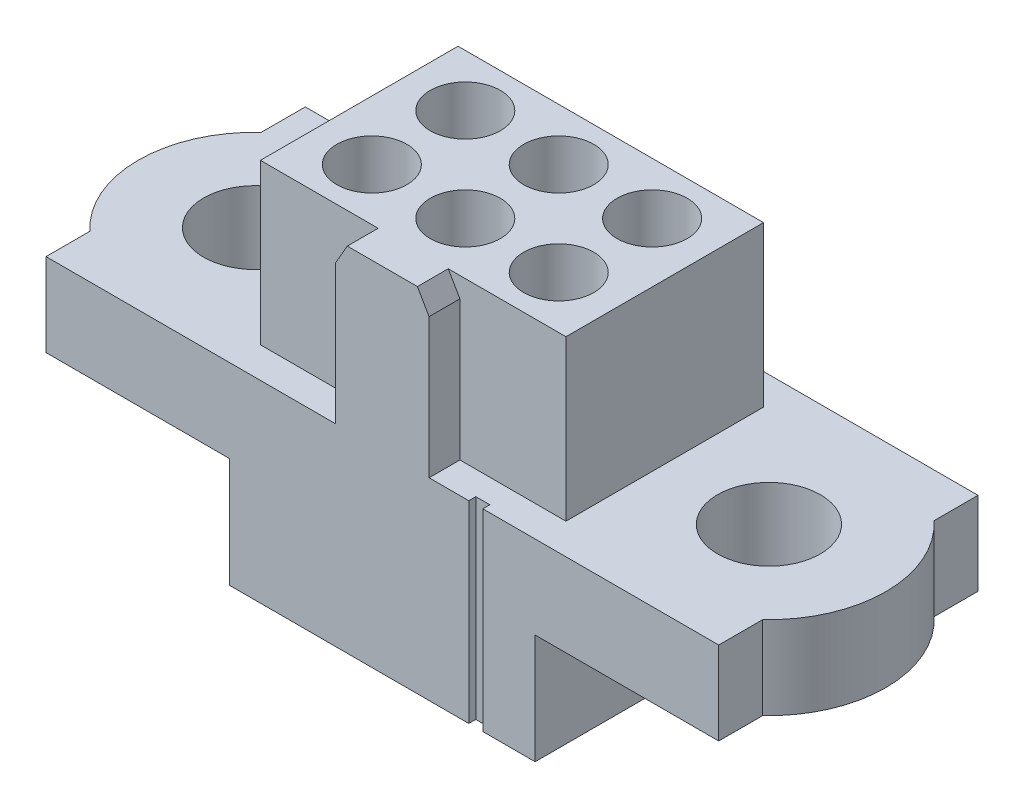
ISO-10303-21;
HEADER;
FILE_DESCRIPTION(('STEP AP214'),'2;1');
FILE_NAME('part.step','',(''),(''),'','','');
FILE_SCHEMA(('AUTOMOTIVE_DESIGN { 1 0 10303 214 1 1 1 1 }'));
ENDSEC;
DATA;
#1=APPLICATION_CONTEXT('core data for automotive mechanical design processes');
#2=APPLICATION_PROTOCOL_DEFINITION('international standard','automotive_design',2000,#1);
#3=PRODUCT_CONTEXT('',#1,'mechanical');
#4=PRODUCT('Part','Part','',(#3));
#5=PRODUCT_RELATED_PRODUCT_CATEGORY('part','',(#4));
#6=PRODUCT_DEFINITION_FORMATION('','',#4);
#7=PRODUCT_DEFINITION_CONTEXT('part definition',#1,'design');
#8=PRODUCT_DEFINITION('design','',#6,#7);
#9=PRODUCT_DEFINITION_SHAPE('','',#8);
#10=(LENGTH_UNIT() NAMED_UNIT(*) SI_UNIT(.MILLI.,.METRE.));
#11=(NAMED_UNIT(*) PLANE_ANGLE_UNIT() SI_UNIT($,.RADIAN.));
#12=(NAMED_UNIT(*) SI_UNIT($,.STERADIAN.) SOLID_ANGLE_UNIT());
#13=UNCERTAINTY_MEASURE_WITH_UNIT(LENGTH_MEASURE(1.E-05),#10,'distance_accuracy_value','');
#14=(GEOMETRIC_REPRESENTATION_CONTEXT(3) GLOBAL_UNCERTAINTY_ASSIGNED_CONTEXT((#13)) GLOBAL_UNIT_ASSIGNED_CONTEXT((#10,
#11,#12)) REPRESENTATION_CONTEXT('',''));
#15=CARTESIAN_POINT('',(0.,0.,0.));
#16=DIRECTION('',(0.,0.,1.));
#17=DIRECTION('',(1.,0.,0.));
#18=AXIS2_PLACEMENT_3D('',#15,#16,#17);
#19=CARTESIAN_POINT('',(0.,-7.9275,1.));
#20=DIRECTION('',(0.,1.,0.));
#21=DIRECTION('',(0.,0.,1.));
#22=AXIS2_PLACEMENT_3D('',#19,#20,#21);
#23=CYLINDRICAL_SURFACE('',#22,0.62);
#24=CARTESIAN_POINT('',(0.,-2.85999999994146,1.));
#25=DIRECTION('',(0.,1.,0.));
#26=DIRECTION('',(1.,0.,0.));
#27=AXIS2_PLACEMENT_3D('',#24,#25,#26);
#28=CIRCLE('',#27,0.619999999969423);
#29=CARTESIAN_POINT('',(0.619999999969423,-2.85999999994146,1.));
#30=VERTEX_POINT('',#29);
#31=EDGE_CURVE('E345',#30,#30,#28,.T.);
#32=ORIENTED_EDGE('',*,*,#31,.T.);
#33=EDGE_LOOP('',(#32));
#34=FACE_BOUND('',#33,.T.);
#35=CARTESIAN_POINT('',(0.,-3.6,1.));
#36=DIRECTION('',(0.,1.,0.));
#37=DIRECTION('',(0.,0.,1.));
#38=AXIS2_PLACEMENT_3D('',#35,#36,#37);
#39=CIRCLE('',#38,0.62);
#40=CARTESIAN_POINT('',(0.,-3.6,1.62));
#41=VERTEX_POINT('',#40);
#42=EDGE_CURVE('E22',#41,#41,#39,.F.);
#43=ORIENTED_EDGE('',*,*,#42,.T.);
#44=EDGE_LOOP('',(#43));
#45=FACE_BOUND('',#44,.T.);
#46=ADVANCED_FACE('F19',(#34,#45),#23,.F.);
#47=CARTESIAN_POINT('',(-2.,-7.9275,1.));
#48=DIRECTION('',(0.,1.,0.));
#49=DIRECTION('',(0.,0.,1.));
#50=AXIS2_PLACEMENT_3D('',#47,#48,#49);
#51=CYLINDRICAL_SURFACE('',#50,0.62);
#52=CARTESIAN_POINT('',(-2.,-2.85999999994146,1.));
#53=DIRECTION('',(0.,1.,0.));
#54=DIRECTION('',(1.,0.,0.));
#55=AXIS2_PLACEMENT_3D('',#52,#53,#54);
#56=CIRCLE('',#55,0.620000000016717);
#57=CARTESIAN_POINT('',(-1.37999999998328,-2.85999999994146,1.));
#58=VERTEX_POINT('',#57);
#59=EDGE_CURVE('E341',#58,#58,#56,.T.);
#60=ORIENTED_EDGE('',*,*,#59,.T.);
#61=EDGE_LOOP('',(#60));
#62=FACE_BOUND('',#61,.T.);
#63=CARTESIAN_POINT('',(-2.,-3.6,1.));
#64=DIRECTION('',(0.,1.,0.));
#65=DIRECTION('',(0.,0.,1.));
#66=AXIS2_PLACEMENT_3D('',#63,#64,#65);
#67=CIRCLE('',#66,0.62);
#68=CARTESIAN_POINT('',(-2.,-3.6,1.62));
#69=VERTEX_POINT('',#68);
#70=EDGE_CURVE('E461',#69,#69,#67,.F.);
#71=ORIENTED_EDGE('',*,*,#70,.T.);
#72=EDGE_LOOP('',(#71));
#73=FACE_BOUND('',#72,.T.);
#74=ADVANCED_FACE('F1324',(#62,#73),#51,.F.);
#75=CARTESIAN_POINT('',(2.,-7.9275,-1.));
#76=DIRECTION('',(0.,1.,0.));
#77=DIRECTION('',(0.,0.,1.));
#78=AXIS2_PLACEMENT_3D('',#75,#76,#77);
#79=CYLINDRICAL_SURFACE('',#78,0.62);
#80=CARTESIAN_POINT('',(2.,-2.85999999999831,-1.));
#81=DIRECTION('',(0.,1.,0.));
#82=DIRECTION('',(1.,0.,0.));
#83=AXIS2_PLACEMENT_3D('',#80,#81,#82);
#84=CIRCLE('',#83,0.619999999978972);
#85=CARTESIAN_POINT('',(2.61999999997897,-2.85999999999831,-1.));
#86=VERTEX_POINT('',#85);
#87=EDGE_CURVE('E337',#86,#86,#84,.T.);
#88=ORIENTED_EDGE('',*,*,#87,.T.);
#89=EDGE_LOOP('',(#88));
#90=FACE_BOUND('',#89,.T.);
#91=CARTESIAN_POINT('',(2.,-3.6,-1.));
#92=DIRECTION('',(0.,1.,0.));
#93=DIRECTION('',(0.,0.,1.));
#94=AXIS2_PLACEMENT_3D('',#91,#92,#93);
#95=CIRCLE('',#94,0.62);
#96=CARTESIAN_POINT('',(2.,-3.6,-0.38));
#97=VERTEX_POINT('',#96);
#98=EDGE_CURVE('E458',#97,#97,#95,.F.);
#99=ORIENTED_EDGE('',*,*,#98,.T.);
#100=EDGE_LOOP('',(#99));
#101=FACE_BOUND('',#100,.T.);
#102=ADVANCED_FACE('F1315',(#90,#101),#79,.F.);
#103=CARTESIAN_POINT('',(0.,-7.9275,-1.));
#104=DIRECTION('',(0.,1.,0.));
#105=DIRECTION('',(0.,0.,1.));
#106=AXIS2_PLACEMENT_3D('',#103,#104,#105);
#107=CYLINDRICAL_SURFACE('',#106,0.62);
#108=CARTESIAN_POINT('',(0.,-2.85999999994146,-1.));
#109=DIRECTION('',(0.,1.,0.));
#110=DIRECTION('',(1.,0.,0.));
#111=AXIS2_PLACEMENT_3D('',#108,#109,#110);
#112=CIRCLE('',#111,0.619999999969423);
#113=CARTESIAN_POINT('',(0.619999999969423,-2.85999999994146,-1.));
#114=VERTEX_POINT('',#113);
#115=EDGE_CURVE('E333',#114,#114,#112,.T.);
#116=ORIENTED_EDGE('',*,*,#115,.T.);
#117=EDGE_LOOP('',(#116));
#118=FACE_BOUND('',#117,.T.);
#119=CARTESIAN_POINT('',(0.,-3.6,-1.));
#120=DIRECTION('',(0.,1.,0.));
#121=DIRECTION('',(0.,0.,1.));
#122=AXIS2_PLACEMENT_3D('',#119,#120,#121);
#123=CIRCLE('',#122,0.62);
#124=CARTESIAN_POINT('',(0.,-3.6,-0.38));
#125=VERTEX_POINT('',#124);
#126=EDGE_CURVE('E454',#125,#125,#123,.F.);
#127=ORIENTED_EDGE('',*,*,#126,.T.);
#128=EDGE_LOOP('',(#127));
#129=FACE_BOUND('',#128,.T.);
#130=ADVANCED_FACE('F1306',(#118,#129),#107,.F.);
#131=CARTESIAN_POINT('',(-2.,-7.9275,-1.));
#132=DIRECTION('',(0.,1.,0.));
#133=DIRECTION('',(0.,0.,1.));
#134=AXIS2_PLACEMENT_3D('',#131,#132,#133);
#135=CYLINDRICAL_SURFACE('',#134,0.62);
#136=CARTESIAN_POINT('',(-2.,-2.85999999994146,-1.));
#137=DIRECTION('',(0.,1.,0.));
#138=DIRECTION('',(1.,0.,0.));
#139=AXIS2_PLACEMENT_3D('',#136,#137,#138);
#140=CIRCLE('',#139,0.620000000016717);
#141=CARTESIAN_POINT('',(-1.37999999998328,-2.85999999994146,-1.));
#142=VERTEX_POINT('',#141);
#143=EDGE_CURVE('E325',#142,#142,#140,.T.);
#144=ORIENTED_EDGE('',*,*,#143,.T.);
#145=EDGE_LOOP('',(#144));
#146=FACE_BOUND('',#145,.T.);
#147=CARTESIAN_POINT('',(-2.,-3.6,-1.));
#148=DIRECTION('',(0.,1.,0.));
#149=DIRECTION('',(0.,0.,1.));
#150=AXIS2_PLACEMENT_3D('',#147,#148,#149);
#151=CIRCLE('',#150,0.62);
#152=CARTESIAN_POINT('',(-2.,-3.6,-0.38));
#153=VERTEX_POINT('',#152);
#154=EDGE_CURVE('E450',#153,#153,#151,.F.);
#155=ORIENTED_EDGE('',*,*,#154,.T.);
#156=EDGE_LOOP('',(#155));
#157=FACE_BOUND('',#156,.T.);
#158=ADVANCED_FACE('F1297',(#146,#157),#135,.F.);
#159=CARTESIAN_POINT('',(2.,-7.9275,1.));
#160=DIRECTION('',(0.,1.,0.));
#161=DIRECTION('',(0.,0.,1.));
#162=AXIS2_PLACEMENT_3D('',#159,#160,#161);
#163=CYLINDRICAL_SURFACE('',#162,0.62);
#164=CARTESIAN_POINT('',(2.,-2.85999999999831,1.));
#165=DIRECTION('',(0.,1.,0.));
#166=DIRECTION('',(1.,0.,0.));
#167=AXIS2_PLACEMENT_3D('',#164,#165,#166);
#168=CIRCLE('',#167,0.619999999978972);
#169=CARTESIAN_POINT('',(2.61999999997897,-2.85999999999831,1.));
#170=VERTEX_POINT('',#169);
#171=EDGE_CURVE('E329',#170,#170,#168,.T.);
#172=ORIENTED_EDGE('',*,*,#171,.T.);
#173=EDGE_LOOP('',(#172));
#174=FACE_BOUND('',#173,.T.);
#175=CARTESIAN_POINT('',(2.,-3.6,1.));
#176=DIRECTION('',(0.,1.,0.));
#177=DIRECTION('',(0.,0.,1.));
#178=AXIS2_PLACEMENT_3D('',#175,#176,#177);
#179=CIRCLE('',#178,0.62);
#180=CARTESIAN_POINT('',(2.,-3.6,1.62));
#181=VERTEX_POINT('',#180);
#182=EDGE_CURVE('E324',#181,#181,#179,.F.);
#183=ORIENTED_EDGE('',*,*,#182,.T.);
#184=EDGE_LOOP('',(#183));
#185=FACE_BOUND('',#184,.T.);
#186=ADVANCED_FACE('F1288',(#174,#185),#163,.F.);
#187=CARTESIAN_POINT('',(0.,-2.63483339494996,1.));
#188=DIRECTION('',(0.,1.,0.));
#189=DIRECTION('',(0.,0.,1.));
#190=AXIS2_PLACEMENT_3D('',#187,#188,#189);
#191=CONICAL_SURFACE('',#190,0.749999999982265,0.523598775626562);
#192=CARTESIAN_POINT('',(0.,-2.634833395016,1.));
#193=DIRECTION('',(0.,1.,0.));
#194=DIRECTION('',(0.,0.,1.));
#195=AXIS2_PLACEMENT_3D('',#192,#193,#194);
#196=CIRCLE('',#195,0.75);
#197=CARTESIAN_POINT('',(0.,-2.634833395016,1.75));
#198=VERTEX_POINT('',#197);
#199=EDGE_CURVE('E320',#198,#198,#196,.T.);
#200=ORIENTED_EDGE('',*,*,#199,.T.);
#201=EDGE_LOOP('',(#200));
#202=FACE_BOUND('',#201,.T.);
#203=ORIENTED_EDGE('',*,*,#31,.F.);
#204=EDGE_LOOP('',(#203));
#205=FACE_BOUND('',#204,.T.);
#206=ADVANCED_FACE('F1279',(#202,#205),#191,.F.);
#207=CARTESIAN_POINT('',(-2.,-2.63483339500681,1.));
#208=DIRECTION('',(0.,1.,0.));
#209=DIRECTION('',(0.,0.,1.));
#210=AXIS2_PLACEMENT_3D('',#207,#208,#209);
#211=CONICAL_SURFACE('',#210,0.749999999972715,0.523598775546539);
#212=CARTESIAN_POINT('',(-2.,-2.634833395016,1.));
#213=DIRECTION('',(0.,1.,0.));
#214=DIRECTION('',(0.,0.,1.));
#215=AXIS2_PLACEMENT_3D('',#212,#213,#214);
#216=CIRCLE('',#215,0.75);
#217=CARTESIAN_POINT('',(-2.,-2.634833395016,1.75));
#218=VERTEX_POINT('',#217);
#219=EDGE_CURVE('E316',#218,#218,#216,.T.);
#220=ORIENTED_EDGE('',*,*,#219,.T.);
#221=EDGE_LOOP('',(#220));
#222=FACE_BOUND('',#221,.T.);
#223=ORIENTED_EDGE('',*,*,#59,.F.);
#224=EDGE_LOOP('',(#223));
#225=FACE_BOUND('',#224,.T.);
#226=ADVANCED_FACE('F1270',(#222,#225),#211,.F.);
#227=CARTESIAN_POINT('',(2.,-2.63483339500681,-1.));
#228=DIRECTION('',(0.,1.,0.));
#229=DIRECTION('',(0.,0.,1.));
#230=AXIS2_PLACEMENT_3D('',#227,#228,#229);
#231=CONICAL_SURFACE('',#230,0.749999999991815,0.523598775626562);
#232=CARTESIAN_POINT('',(2.,-2.634833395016,-1.));
#233=DIRECTION('',(0.,1.,0.));
#234=DIRECTION('',(0.,0.,1.));
#235=AXIS2_PLACEMENT_3D('',#232,#233,#234);
#236=CIRCLE('',#235,0.75);
#237=CARTESIAN_POINT('',(2.,-2.634833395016,-0.25));
#238=VERTEX_POINT('',#237);
#239=EDGE_CURVE('E312',#238,#238,#236,.T.);
#240=ORIENTED_EDGE('',*,*,#239,.T.);
#241=EDGE_LOOP('',(#240));
#242=FACE_BOUND('',#241,.T.);
#243=ORIENTED_EDGE('',*,*,#87,.F.);
#244=EDGE_LOOP('',(#243));
#245=FACE_BOUND('',#244,.T.);
#246=ADVANCED_FACE('F1261',(#242,#245),#231,.F.);
#247=CARTESIAN_POINT('',(0.,-2.63483339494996,-1.));
#248=DIRECTION('',(0.,1.,0.));
#249=DIRECTION('',(0.,0.,1.));
#250=AXIS2_PLACEMENT_3D('',#247,#248,#249);
#251=CONICAL_SURFACE('',#250,0.749999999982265,0.523598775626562);
#252=CARTESIAN_POINT('',(0.,-2.634833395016,-1.));
#253=DIRECTION('',(0.,1.,0.));
#254=DIRECTION('',(0.,0.,1.));
#255=AXIS2_PLACEMENT_3D('',#252,#253,#254);
#256=CIRCLE('',#255,0.75);
#257=CARTESIAN_POINT('',(0.,-2.634833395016,-0.25));
#258=VERTEX_POINT('',#257);
#259=EDGE_CURVE('E308',#258,#258,#256,.T.);
#260=ORIENTED_EDGE('',*,*,#259,.T.);
#261=EDGE_LOOP('',(#260));
#262=FACE_BOUND('',#261,.T.);
#263=ORIENTED_EDGE('',*,*,#115,.F.);
#264=EDGE_LOOP('',(#263));
#265=FACE_BOUND('',#264,.T.);
#266=ADVANCED_FACE('F1252',(#262,#265),#251,.F.);
#267=CARTESIAN_POINT('',(2.,-2.63483339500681,1.));
#268=DIRECTION('',(0.,1.,0.));
#269=DIRECTION('',(0.,0.,1.));
#270=AXIS2_PLACEMENT_3D('',#267,#268,#269);
#271=CONICAL_SURFACE('',#270,0.749999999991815,0.523598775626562);
#272=CARTESIAN_POINT('',(2.,-2.634833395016,1.));
#273=DIRECTION('',(0.,1.,0.));
#274=DIRECTION('',(0.,0.,1.));
#275=AXIS2_PLACEMENT_3D('',#272,#273,#274);
#276=CIRCLE('',#275,0.75);
#277=CARTESIAN_POINT('',(2.,-2.634833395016,1.75));
#278=VERTEX_POINT('',#277);
#279=EDGE_CURVE('E304',#278,#278,#276,.T.);
#280=ORIENTED_EDGE('',*,*,#279,.T.);
#281=EDGE_LOOP('',(#280));
#282=FACE_BOUND('',#281,.T.);
#283=ORIENTED_EDGE('',*,*,#171,.F.);
#284=EDGE_LOOP('',(#283));
#285=FACE_BOUND('',#284,.T.);
#286=ADVANCED_FACE('F1243',(#282,#285),#271,.F.);
#287=CARTESIAN_POINT('',(-2.,-2.63483339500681,-1.));
#288=DIRECTION('',(0.,1.,0.));
#289=DIRECTION('',(0.,0.,1.));
#290=AXIS2_PLACEMENT_3D('',#287,#288,#289);
#291=CONICAL_SURFACE('',#290,0.749999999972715,0.523598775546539);
#292=CARTESIAN_POINT('',(-2.,-2.634833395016,-1.));
#293=DIRECTION('',(0.,1.,0.));
#294=DIRECTION('',(0.,0.,1.));
#295=AXIS2_PLACEMENT_3D('',#292,#293,#294);
#296=CIRCLE('',#295,0.75);
#297=CARTESIAN_POINT('',(-2.,-2.634833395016,-0.25));
#298=VERTEX_POINT('',#297);
#299=EDGE_CURVE('E299',#298,#298,#296,.T.);
#300=ORIENTED_EDGE('',*,*,#299,.T.);
#301=EDGE_LOOP('',(#300));
#302=FACE_BOUND('',#301,.T.);
#303=ORIENTED_EDGE('',*,*,#143,.F.);
#304=EDGE_LOOP('',(#303));
#305=FACE_BOUND('',#304,.T.);
#306=ADVANCED_FACE('F478',(#302,#305),#291,.F.);
#307=CARTESIAN_POINT('',(0.,-3.6,1.));
#308=DIRECTION('',(0.,1.,0.));
#309=DIRECTION('',(0.,0.,1.));
#310=AXIS2_PLACEMENT_3D('',#307,#308,#309);
#311=PLANE('',#310);
#312=ORIENTED_EDGE('',*,*,#42,.F.);
#313=EDGE_LOOP('',(#312));
#314=FACE_BOUND('',#313,.T.);
#315=CARTESIAN_POINT('',(0.,-3.6,1.));
#316=DIRECTION('',(0.,1.,0.));
#317=DIRECTION('',(0.,0.,1.));
#318=AXIS2_PLACEMENT_3D('',#315,#316,#317);
#319=CIRCLE('',#318,0.795);
#320=CARTESIAN_POINT('',(0.,-3.6,1.795));
#321=VERTEX_POINT('',#320);
#322=EDGE_CURVE('E303',#321,#321,#319,.F.);
#323=ORIENTED_EDGE('',*,*,#322,.T.);
#324=EDGE_LOOP('',(#323));
#325=FACE_BOUND('',#324,.T.);
#326=ADVANCED_FACE('F474',(#314,#325),#311,.F.);
#327=CARTESIAN_POINT('',(-2.,-3.6,1.));
#328=DIRECTION('',(0.,1.,0.));
#329=DIRECTION('',(0.,0.,1.));
#330=AXIS2_PLACEMENT_3D('',#327,#328,#329);
#331=PLANE('',#330);
#332=ORIENTED_EDGE('',*,*,#70,.F.);
#333=EDGE_LOOP('',(#332));
#334=FACE_BOUND('',#333,.T.);
#335=CARTESIAN_POINT('',(-2.,-3.6,1.));
#336=DIRECTION('',(0.,1.,0.));
#337=DIRECTION('',(0.,0.,1.));
#338=AXIS2_PLACEMENT_3D('',#335,#336,#337);
#339=CIRCLE('',#338,0.795);
#340=CARTESIAN_POINT('',(-2.,-3.6,1.795));
#341=VERTEX_POINT('',#340);
#342=EDGE_CURVE('E440',#341,#341,#339,.F.);
#343=ORIENTED_EDGE('',*,*,#342,.T.);
#344=EDGE_LOOP('',(#343));
#345=FACE_BOUND('',#344,.T.);
#346=ADVANCED_FACE('F477',(#334,#345),#331,.F.);
#347=CARTESIAN_POINT('',(2.,-3.6,-1.));
#348=DIRECTION('',(0.,1.,0.));
#349=DIRECTION('',(0.,0.,1.));
#350=AXIS2_PLACEMENT_3D('',#347,#348,#349);
#351=PLANE('',#350);
#352=ORIENTED_EDGE('',*,*,#98,.F.);
#353=EDGE_LOOP('',(#352));
#354=FACE_BOUND('',#353,.T.);
#355=CARTESIAN_POINT('',(2.,-3.6,-1.));
#356=DIRECTION('',(0.,1.,0.));
#357=DIRECTION('',(0.,0.,1.));
#358=AXIS2_PLACEMENT_3D('',#355,#356,#357);
#359=CIRCLE('',#358,0.795);
#360=CARTESIAN_POINT('',(2.,-3.6,-0.205));
#361=VERTEX_POINT('',#360);
#362=EDGE_CURVE('E436',#361,#361,#359,.F.);
#363=ORIENTED_EDGE('',*,*,#362,.T.);
#364=EDGE_LOOP('',(#363));
#365=FACE_BOUND('',#364,.T.);
#366=ADVANCED_FACE('F1213',(#354,#365),#351,.F.);
#367=CARTESIAN_POINT('',(0.,-3.6,-1.));
#368=DIRECTION('',(0.,1.,0.));
#369=DIRECTION('',(0.,0.,1.));
#370=AXIS2_PLACEMENT_3D('',#367,#368,#369);
#371=PLANE('',#370);
#372=ORIENTED_EDGE('',*,*,#126,.F.);
#373=EDGE_LOOP('',(#372));
#374=FACE_BOUND('',#373,.T.);
#375=CARTESIAN_POINT('',(0.,-3.6,-1.));
#376=DIRECTION('',(0.,1.,0.));
#377=DIRECTION('',(0.,0.,1.));
#378=AXIS2_PLACEMENT_3D('',#375,#376,#377);
#379=CIRCLE('',#378,0.795);
#380=CARTESIAN_POINT('',(0.,-3.6,-0.205));
#381=VERTEX_POINT('',#380);
#382=EDGE_CURVE('E432',#381,#381,#379,.F.);
#383=ORIENTED_EDGE('',*,*,#382,.T.);
#384=EDGE_LOOP('',(#383));
#385=FACE_BOUND('',#384,.T.);
#386=ADVANCED_FACE('F1204',(#374,#385),#371,.F.);
#387=CARTESIAN_POINT('',(-2.,-3.6,-1.));
#388=DIRECTION('',(0.,1.,0.));
#389=DIRECTION('',(0.,0.,1.));
#390=AXIS2_PLACEMENT_3D('',#387,#388,#389);
#391=PLANE('',#390);
#392=ORIENTED_EDGE('',*,*,#154,.F.);
#393=EDGE_LOOP('',(#392));
#394=FACE_BOUND('',#393,.T.);
#395=CARTESIAN_POINT('',(-2.,-3.6,-1.));
#396=DIRECTION('',(0.,1.,0.));
#397=DIRECTION('',(0.,0.,1.));
#398=AXIS2_PLACEMENT_3D('',#395,#396,#397);
#399=CIRCLE('',#398,0.795);
#400=CARTESIAN_POINT('',(-2.,-3.6,-0.205));
#401=VERTEX_POINT('',#400);
#402=EDGE_CURVE('E428',#401,#401,#399,.F.);
#403=ORIENTED_EDGE('',*,*,#402,.T.);
#404=EDGE_LOOP('',(#403));
#405=FACE_BOUND('',#404,.T.);
#406=ADVANCED_FACE('F1195',(#394,#405),#391,.F.);
#407=CARTESIAN_POINT('',(2.,-3.6,1.));
#408=DIRECTION('',(0.,1.,0.));
#409=DIRECTION('',(0.,0.,1.));
#410=AXIS2_PLACEMENT_3D('',#407,#408,#409);
#411=PLANE('',#410);
#412=ORIENTED_EDGE('',*,*,#182,.F.);
#413=EDGE_LOOP('',(#412));
#414=FACE_BOUND('',#413,.T.);
#415=CARTESIAN_POINT('',(2.,-3.6,1.));
#416=DIRECTION('',(0.,1.,0.));
#417=DIRECTION('',(0.,0.,1.));
#418=AXIS2_PLACEMENT_3D('',#415,#416,#417);
#419=CIRCLE('',#418,0.795);
#420=CARTESIAN_POINT('',(2.,-3.6,1.795));
#421=VERTEX_POINT('',#420);
#422=EDGE_CURVE('E279',#421,#421,#419,.F.);
#423=ORIENTED_EDGE('',*,*,#422,.T.);
#424=EDGE_LOOP('',(#423));
#425=FACE_BOUND('',#424,.T.);
#426=ADVANCED_FACE('F1186',(#414,#425),#411,.F.);
#427=CARTESIAN_POINT('',(0.,-7.9275,1.));
#428=DIRECTION('',(0.,1.,0.));
#429=DIRECTION('',(0.,0.,1.));
#430=AXIS2_PLACEMENT_3D('',#427,#428,#429);
#431=CYLINDRICAL_SURFACE('',#430,0.75);
#432=ORIENTED_EDGE('',*,*,#199,.F.);
#433=EDGE_LOOP('',(#432));
#434=FACE_BOUND('',#433,.T.);
#435=CARTESIAN_POINT('',(0.,0.,1.));
#436=DIRECTION('',(0.,1.,0.));
#437=DIRECTION('',(0.,0.,1.));
#438=AXIS2_PLACEMENT_3D('',#435,#436,#437);
#439=CIRCLE('',#438,0.75);
#440=CARTESIAN_POINT('',(0.,0.,1.75));
#441=VERTEX_POINT('',#440);
#442=EDGE_CURVE('E421',#441,#441,#439,.T.);
#443=ORIENTED_EDGE('',*,*,#442,.T.);
#444=EDGE_LOOP('',(#443));
#445=FACE_BOUND('',#444,.T.);
#446=ADVANCED_FACE('F1177',(#434,#445),#431,.F.);
#447=CARTESIAN_POINT('',(-2.,-7.9275,1.));
#448=DIRECTION('',(0.,1.,0.));
#449=DIRECTION('',(0.,0.,1.));
#450=AXIS2_PLACEMENT_3D('',#447,#448,#449);
#451=CYLINDRICAL_SURFACE('',#450,0.75);
#452=ORIENTED_EDGE('',*,*,#219,.F.);
#453=EDGE_LOOP('',(#452));
#454=FACE_BOUND('',#453,.T.);
#455=CARTESIAN_POINT('',(-2.,0.,1.));
#456=DIRECTION('',(0.,1.,0.));
#457=DIRECTION('',(0.,0.,1.));
#458=AXIS2_PLACEMENT_3D('',#455,#456,#457);
#459=CIRCLE('',#458,0.75);
#460=CARTESIAN_POINT('',(-2.,0.,1.75));
#461=VERTEX_POINT('',#460);
#462=EDGE_CURVE('E417',#461,#461,#459,.T.);
#463=ORIENTED_EDGE('',*,*,#462,.T.);
#464=EDGE_LOOP('',(#463));
#465=FACE_BOUND('',#464,.T.);
#466=ADVANCED_FACE('F1168',(#454,#465),#451,.F.);
#467=CARTESIAN_POINT('',(2.,-7.9275,-1.));
#468=DIRECTION('',(0.,1.,0.));
#469=DIRECTION('',(0.,0.,1.));
#470=AXIS2_PLACEMENT_3D('',#467,#468,#469);
#471=CYLINDRICAL_SURFACE('',#470,0.75);
#472=ORIENTED_EDGE('',*,*,#239,.F.);
#473=EDGE_LOOP('',(#472));
#474=FACE_BOUND('',#473,.T.);
#475=CARTESIAN_POINT('',(2.,0.,-1.));
#476=DIRECTION('',(0.,1.,0.));
#477=DIRECTION('',(0.,0.,1.));
#478=AXIS2_PLACEMENT_3D('',#475,#476,#477);
#479=CIRCLE('',#478,0.75);
#480=CARTESIAN_POINT('',(2.,0.,-0.25));
#481=VERTEX_POINT('',#480);
#482=EDGE_CURVE('E413',#481,#481,#479,.T.);
#483=ORIENTED_EDGE('',*,*,#482,.T.);
#484=EDGE_LOOP('',(#483));
#485=FACE_BOUND('',#484,.T.);
#486=ADVANCED_FACE('F1159',(#474,#485),#471,.F.);
#487=CARTESIAN_POINT('',(0.,-7.9275,-1.));
#488=DIRECTION('',(0.,1.,0.));
#489=DIRECTION('',(0.,0.,1.));
#490=AXIS2_PLACEMENT_3D('',#487,#488,#489);
#491=CYLINDRICAL_SURFACE('',#490,0.75);
#492=ORIENTED_EDGE('',*,*,#259,.F.);
#493=EDGE_LOOP('',(#492));
#494=FACE_BOUND('',#493,.T.);
#495=CARTESIAN_POINT('',(0.,0.,-1.));
#496=DIRECTION('',(0.,1.,0.));
#497=DIRECTION('',(0.,0.,1.));
#498=AXIS2_PLACEMENT_3D('',#495,#496,#497);
#499=CIRCLE('',#498,0.75);
#500=CARTESIAN_POINT('',(0.,0.,-0.25));
#501=VERTEX_POINT('',#500);
#502=EDGE_CURVE('E409',#501,#501,#499,.T.);
#503=ORIENTED_EDGE('',*,*,#502,.T.);
#504=EDGE_LOOP('',(#503));
#505=FACE_BOUND('',#504,.T.);
#506=ADVANCED_FACE('F1150',(#494,#505),#491,.F.);
#507=CARTESIAN_POINT('',(2.,-7.9275,1.));
#508=DIRECTION('',(0.,1.,0.));
#509=DIRECTION('',(0.,0.,1.));
#510=AXIS2_PLACEMENT_3D('',#507,#508,#509);
#511=CYLINDRICAL_SURFACE('',#510,0.75);
#512=ORIENTED_EDGE('',*,*,#279,.F.);
#513=EDGE_LOOP('',(#512));
#514=FACE_BOUND('',#513,.T.);
#515=CARTESIAN_POINT('',(2.,0.,1.));
#516=DIRECTION('',(0.,1.,0.));
#517=DIRECTION('',(0.,0.,1.));
#518=AXIS2_PLACEMENT_3D('',#515,#516,#517);
#519=CIRCLE('',#518,0.75);
#520=CARTESIAN_POINT('',(2.,0.,1.75));
#521=VERTEX_POINT('',#520);
#522=EDGE_CURVE('E405',#521,#521,#519,.T.);
#523=ORIENTED_EDGE('',*,*,#522,.T.);
#524=EDGE_LOOP('',(#523));
#525=FACE_BOUND('',#524,.T.);
#526=ADVANCED_FACE('F1141',(#514,#525),#511,.F.);
#527=CARTESIAN_POINT('',(-2.,-7.9275,-1.));
#528=DIRECTION('',(0.,1.,0.));
#529=DIRECTION('',(0.,0.,1.));
#530=AXIS2_PLACEMENT_3D('',#527,#528,#529);
#531=CYLINDRICAL_SURFACE('',#530,0.75);
#532=ORIENTED_EDGE('',*,*,#299,.F.);
#533=EDGE_LOOP('',(#532));
#534=FACE_BOUND('',#533,.T.);
#535=CARTESIAN_POINT('',(-2.,0.,-1.));
#536=DIRECTION('',(0.,1.,0.));
#537=DIRECTION('',(0.,0.,1.));
#538=AXIS2_PLACEMENT_3D('',#535,#536,#537);
#539=CIRCLE('',#538,0.75);
#540=CARTESIAN_POINT('',(-2.,0.,-0.25));
#541=VERTEX_POINT('',#540);
#542=EDGE_CURVE('E400',#541,#541,#539,.T.);
#543=ORIENTED_EDGE('',*,*,#542,.T.);
#544=EDGE_LOOP('',(#543));
#545=FACE_BOUND('',#544,.T.);
#546=ADVANCED_FACE('F486',(#534,#545),#531,.F.);
#547=CARTESIAN_POINT('',(0.,-7.9275,1.));
#548=DIRECTION('',(0.,1.,0.));
#549=DIRECTION('',(0.,0.,1.));
#550=AXIS2_PLACEMENT_3D('',#547,#548,#549);
#551=CYLINDRICAL_SURFACE('',#550,0.795);
#552=ORIENTED_EDGE('',*,*,#322,.F.);
#553=EDGE_LOOP('',(#552));
#554=FACE_BOUND('',#553,.T.);
#555=CARTESIAN_POINT('',(0.,-7.55,1.));
#556=DIRECTION('',(0.,1.,0.));
#557=DIRECTION('',(0.,0.,1.));
#558=AXIS2_PLACEMENT_3D('',#555,#556,#557);
#559=CIRCLE('',#558,0.795);
#560=CARTESIAN_POINT('',(0.,-7.55,1.795));
#561=VERTEX_POINT('',#560);
#562=EDGE_CURVE('E395',#561,#561,#559,.T.);
#563=ORIENTED_EDGE('',*,*,#562,.F.);
#564=EDGE_LOOP('',(#563));
#565=FACE_BOUND('',#564,.T.);
#566=ADVANCED_FACE('F482',(#554,#565),#551,.F.);
#567=CARTESIAN_POINT('',(-2.,-7.9275,1.));
#568=DIRECTION('',(0.,1.,0.));
#569=DIRECTION('',(0.,0.,1.));
#570=AXIS2_PLACEMENT_3D('',#567,#568,#569);
#571=CYLINDRICAL_SURFACE('',#570,0.795);
#572=ORIENTED_EDGE('',*,*,#342,.F.);
#573=EDGE_LOOP('',(#572));
#574=FACE_BOUND('',#573,.T.);
#575=CARTESIAN_POINT('',(-2.,-7.55,1.));
#576=DIRECTION('',(0.,1.,0.));
#577=DIRECTION('',(0.,0.,1.));
#578=AXIS2_PLACEMENT_3D('',#575,#576,#577);
#579=CIRCLE('',#578,0.795);
#580=CARTESIAN_POINT('',(-2.,-7.55,1.795));
#581=VERTEX_POINT('',#580);
#582=EDGE_CURVE('E391',#581,#581,#579,.T.);
#583=ORIENTED_EDGE('',*,*,#582,.F.);
#584=EDGE_LOOP('',(#583));
#585=FACE_BOUND('',#584,.T.);
#586=ADVANCED_FACE('F485',(#574,#585),#571,.F.);
#587=CARTESIAN_POINT('',(2.,-7.9275,-1.));
#588=DIRECTION('',(0.,1.,0.));
#589=DIRECTION('',(0.,0.,1.));
#590=AXIS2_PLACEMENT_3D('',#587,#588,#589);
#591=CYLINDRICAL_SURFACE('',#590,0.795);
#592=ORIENTED_EDGE('',*,*,#362,.F.);
#593=EDGE_LOOP('',(#592));
#594=FACE_BOUND('',#593,.T.);
#595=CARTESIAN_POINT('',(2.,-7.55,-1.));
#596=DIRECTION('',(0.,1.,0.));
#597=DIRECTION('',(0.,0.,1.));
#598=AXIS2_PLACEMENT_3D('',#595,#596,#597);
#599=CIRCLE('',#598,0.795);
#600=CARTESIAN_POINT('',(2.,-7.55,-0.205));
#601=VERTEX_POINT('',#600);
#602=EDGE_CURVE('E387',#601,#601,#599,.T.);
#603=ORIENTED_EDGE('',*,*,#602,.F.);
#604=EDGE_LOOP('',(#603));
#605=FACE_BOUND('',#604,.T.);
#606=ADVANCED_FACE('F1111',(#594,#605),#591,.F.);
#607=CARTESIAN_POINT('',(0.,-7.9275,-1.));
#608=DIRECTION('',(0.,1.,0.));
#609=DIRECTION('',(0.,0.,1.));
#610=AXIS2_PLACEMENT_3D('',#607,#608,#609);
#611=CYLINDRICAL_SURFACE('',#610,0.795);
#612=ORIENTED_EDGE('',*,*,#382,.F.);
#613=EDGE_LOOP('',(#612));
#614=FACE_BOUND('',#613,.T.);
#615=CARTESIAN_POINT('',(0.,-7.55,-1.));
#616=DIRECTION('',(0.,1.,0.));
#617=DIRECTION('',(0.,0.,1.));
#618=AXIS2_PLACEMENT_3D('',#615,#616,#617);
#619=CIRCLE('',#618,0.795);
#620=CARTESIAN_POINT('',(0.,-7.55,-0.205));
#621=VERTEX_POINT('',#620);
#622=EDGE_CURVE('E383',#621,#621,#619,.T.);
#623=ORIENTED_EDGE('',*,*,#622,.F.);
#624=EDGE_LOOP('',(#623));
#625=FACE_BOUND('',#624,.T.);
#626=ADVANCED_FACE('F1102',(#614,#625),#611,.F.);
#627=CARTESIAN_POINT('',(-2.,-7.9275,-1.));
#628=DIRECTION('',(0.,1.,0.));
#629=DIRECTION('',(0.,0.,1.));
#630=AXIS2_PLACEMENT_3D('',#627,#628,#629);
#631=CYLINDRICAL_SURFACE('',#630,0.795);
#632=ORIENTED_EDGE('',*,*,#402,.F.);
#633=EDGE_LOOP('',(#632));
#634=FACE_BOUND('',#633,.T.);
#635=CARTESIAN_POINT('',(-2.,-7.55,-1.));
#636=DIRECTION('',(0.,1.,0.));
#637=DIRECTION('',(0.,0.,1.));
#638=AXIS2_PLACEMENT_3D('',#635,#636,#637);
#639=CIRCLE('',#638,0.795);
#640=CARTESIAN_POINT('',(-2.,-7.55,-0.205));
#641=VERTEX_POINT('',#640);
#642=EDGE_CURVE('E379',#641,#641,#639,.T.);
#643=ORIENTED_EDGE('',*,*,#642,.F.);
#644=EDGE_LOOP('',(#643));
#645=FACE_BOUND('',#644,.T.);
#646=ADVANCED_FACE('F1093',(#634,#645),#631,.F.);
#647=CARTESIAN_POINT('',(2.,-7.9275,1.));
#648=DIRECTION('',(0.,1.,0.));
#649=DIRECTION('',(0.,0.,1.));
#650=AXIS2_PLACEMENT_3D('',#647,#648,#649);
#651=CYLINDRICAL_SURFACE('',#650,0.795);
#652=ORIENTED_EDGE('',*,*,#422,.F.);
#653=EDGE_LOOP('',(#652));
#654=FACE_BOUND('',#653,.T.);
#655=CARTESIAN_POINT('',(2.,-7.55,1.));
#656=DIRECTION('',(0.,1.,0.));
#657=DIRECTION('',(0.,0.,1.));
#658=AXIS2_PLACEMENT_3D('',#655,#656,#657);
#659=CIRCLE('',#658,0.795);
#660=CARTESIAN_POINT('',(2.,-7.55,1.795));
#661=VERTEX_POINT('',#660);
#662=EDGE_CURVE('E374',#661,#661,#659,.T.);
#663=ORIENTED_EDGE('',*,*,#662,.F.);
#664=EDGE_LOOP('',(#663));
#665=FACE_BOUND('',#664,.T.);
#666=ADVANCED_FACE('F1085',(#654,#665),#651,.F.);
#667=CARTESIAN_POINT('',(2.15,-3.42,2.625));
#668=DIRECTION('',(0.,0.,-1.));
#669=DIRECTION('',(-1.,0.,0.));
#670=AXIS2_PLACEMENT_3D('',#667,#668,#669);
#671=PLANE('',#670);
#672=DIRECTION('',(-1.,0.,0.));
#673=VECTOR('',#672,1.);
#674=CARTESIAN_POINT('',(2.15,-3.42,2.625));
#675=LINE('',#674,#673);
#676=CARTESIAN_POINT('',(1.85,-3.42,2.625));
#677=VERTEX_POINT('',#676);
#678=CARTESIAN_POINT('',(2.15,-3.42,2.625));
#679=VERTEX_POINT('',#678);
#680=EDGE_CURVE('E275',#677,#679,#675,.F.);
#681=ORIENTED_EDGE('',*,*,#680,.F.);
#682=DIRECTION('',(0.,1.,0.));
#683=VECTOR('',#682,1.);
#684=CARTESIAN_POINT('',(1.85,-3.42,2.625));
#685=LINE('',#684,#683);
#686=CARTESIAN_POINT('',(1.85,-7.55,2.625));
#687=VERTEX_POINT('',#686);
#688=EDGE_CURVE('E660',#677,#687,#685,.F.);
#689=ORIENTED_EDGE('',*,*,#688,.T.);
#690=DIRECTION('',(1.,0.,0.));
#691=VECTOR('',#690,1.);
#692=CARTESIAN_POINT('',(0.,-7.55,2.625));
#693=LINE('',#692,#691);
#694=CARTESIAN_POINT('',(2.15,-7.55,2.625));
#695=VERTEX_POINT('',#694);
#696=EDGE_CURVE('E653',#695,#687,#693,.F.);
#697=ORIENTED_EDGE('',*,*,#696,.F.);
#698=DIRECTION('',(0.,1.,0.));
#699=VECTOR('',#698,1.);
#700=CARTESIAN_POINT('',(2.15,-3.42,2.625));
#701=LINE('',#700,#699);
#702=EDGE_CURVE('E509',#695,#679,#701,.T.);
#703=ORIENTED_EDGE('',*,*,#702,.T.);
#704=EDGE_LOOP('',(#681,#689,#697,#703));
#705=FACE_BOUND('',#704,.T.);
#706=ADVANCED_FACE('F724',(#705),#671,.F.);
#707=CARTESIAN_POINT('',(0.,0.,0.));
#708=DIRECTION('',(0.,-1.,0.));
#709=DIRECTION('',(0.,0.,-1.));
#710=AXIS2_PLACEMENT_3D('',#707,#708,#709);
#711=PLANE('',#710);
#712=ORIENTED_EDGE('',*,*,#542,.F.);
#713=EDGE_LOOP('',(#712));
#714=FACE_BOUND('',#713,.T.);
#715=ORIENTED_EDGE('',*,*,#522,.F.);
#716=EDGE_LOOP('',(#715));
#717=FACE_BOUND('',#716,.T.);
#718=ORIENTED_EDGE('',*,*,#502,.F.);
#719=EDGE_LOOP('',(#718));
#720=FACE_BOUND('',#719,.T.);
#721=ORIENTED_EDGE('',*,*,#482,.F.);
#722=EDGE_LOOP('',(#721));
#723=FACE_BOUND('',#722,.T.);
#724=ORIENTED_EDGE('',*,*,#462,.F.);
#725=EDGE_LOOP('',(#724));
#726=FACE_BOUND('',#725,.T.);
#727=ORIENTED_EDGE('',*,*,#442,.F.);
#728=EDGE_LOOP('',(#727));
#729=FACE_BOUND('',#728,.T.);
#730=DIRECTION('',(-1.,0.,0.));
#731=VECTOR('',#730,1.);
#732=CARTESIAN_POINT('',(-3.27,0.,-2.115));
#733=LINE('',#732,#731);
#734=CARTESIAN_POINT('',(-3.27,0.,-2.115));
#735=VERTEX_POINT('',#734);
#736=CARTESIAN_POINT('',(3.27,0.,-2.115));
#737=VERTEX_POINT('',#736);
#738=EDGE_CURVE('E594',#735,#737,#733,.F.);
#739=ORIENTED_EDGE('',*,*,#738,.F.);
#740=DIRECTION('',(0.,0.,1.));
#741=VECTOR('',#740,1.);
#742=CARTESIAN_POINT('',(-3.27,0.,2.115));
#743=LINE('',#742,#741);
#744=CARTESIAN_POINT('',(-3.27,0.,2.115));
#745=VERTEX_POINT('',#744);
#746=EDGE_CURVE('E587',#745,#735,#743,.F.);
#747=ORIENTED_EDGE('',*,*,#746,.F.);
#748=DIRECTION('',(1.,0.,0.));
#749=VECTOR('',#748,1.);
#750=CARTESIAN_POINT('',(3.27,0.,2.115));
#751=LINE('',#750,#749);
#752=CARTESIAN_POINT('',(-0.75,0.,2.115));
#753=VERTEX_POINT('',#752);
#754=EDGE_CURVE('E576',#753,#745,#751,.F.);
#755=ORIENTED_EDGE('',*,*,#754,.F.);
#756=DIRECTION('',(0.,0.,1.));
#757=VECTOR('',#756,1.);
#758=CARTESIAN_POINT('',(-0.75,0.,2.775));
#759=LINE('',#758,#757);
#760=CARTESIAN_POINT('',(-0.75,0.,2.775));
#761=VERTEX_POINT('',#760);
#762=EDGE_CURVE('E679',#761,#753,#759,.F.);
#763=ORIENTED_EDGE('',*,*,#762,.F.);
#764=DIRECTION('',(1.,0.,0.));
#765=VECTOR('',#764,1.);
#766=CARTESIAN_POINT('',(0.,0.,2.775));
#767=LINE('',#766,#765);
#768=CARTESIAN_POINT('',(0.75,0.,2.775));
#769=VERTEX_POINT('',#768);
#770=EDGE_CURVE('E278',#769,#761,#767,.F.);
#771=ORIENTED_EDGE('',*,*,#770,.F.);
#772=DIRECTION('',(0.,0.,1.));
#773=VECTOR('',#772,1.);
#774=CARTESIAN_POINT('',(0.75,0.,2.775));
#775=LINE('',#774,#773);
#776=CARTESIAN_POINT('',(0.75,0.,2.115));
#777=VERTEX_POINT('',#776);
#778=EDGE_CURVE('E685',#777,#769,#775,.T.);
#779=ORIENTED_EDGE('',*,*,#778,.F.);
#780=DIRECTION('',(1.,0.,0.));
#781=VECTOR('',#780,1.);
#782=CARTESIAN_POINT('',(3.27,0.,2.115));
#783=LINE('',#782,#781);
#784=CARTESIAN_POINT('',(3.27,0.,2.115));
#785=VERTEX_POINT('',#784);
#786=EDGE_CURVE('E607',#785,#777,#783,.F.);
#787=ORIENTED_EDGE('',*,*,#786,.F.);
#788=DIRECTION('',(0.,0.,-1.));
#789=VECTOR('',#788,1.);
#790=CARTESIAN_POINT('',(3.27,0.,-2.115));
#791=LINE('',#790,#789);
#792=EDGE_CURVE('E600',#737,#785,#791,.F.);
#793=ORIENTED_EDGE('',*,*,#792,.F.);
#794=EDGE_LOOP('',(#739,#747,#755,#763,#771,#779,#787,#793));
#795=FACE_BOUND('',#794,.T.);
#796=ADVANCED_FACE('F803',(#714,#717,#720,#723,#726,#729,#795),#711,.F.);
#797=CARTESIAN_POINT('',(1.,-0.4330127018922,2.775));
#798=DIRECTION('',(1.,0.,0.));
#799=DIRECTION('',(0.,0.,-1.));
#800=AXIS2_PLACEMENT_3D('',#797,#798,#799);
#801=PLANE('',#800);
#802=DIRECTION('',(0.,0.,-1.));
#803=VECTOR('',#802,1.);
#804=CARTESIAN_POINT('',(1.,-3.42,2.775));
#805=LINE('',#804,#803);
#806=CARTESIAN_POINT('',(1.,-3.42,2.775));
#807=VERTEX_POINT('',#806);
#808=CARTESIAN_POINT('',(1.,-3.42,2.115));
#809=VERTEX_POINT('',#808);
#810=EDGE_CURVE('E404',#807,#809,#805,.T.);
#811=ORIENTED_EDGE('',*,*,#810,.T.);
#812=DIRECTION('',(0.,1.,0.));
#813=VECTOR('',#812,1.);
#814=CARTESIAN_POINT('',(1.,0.,2.115));
#815=LINE('',#814,#813);
#816=CARTESIAN_POINT('',(1.,-0.4330127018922,2.115));
#817=VERTEX_POINT('',#816);
#818=EDGE_CURVE('E610',#817,#809,#815,.F.);
#819=ORIENTED_EDGE('',*,*,#818,.F.);
#820=DIRECTION('',(0.,0.,1.));
#821=VECTOR('',#820,1.);
#822=CARTESIAN_POINT('',(1.,-0.4330127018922,2.775));
#823=LINE('',#822,#821);
#824=CARTESIAN_POINT('',(1.,-0.4330127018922,2.775));
#825=VERTEX_POINT('',#824);
#826=EDGE_CURVE('E682',#825,#817,#823,.F.);
#827=ORIENTED_EDGE('',*,*,#826,.F.);
#828=DIRECTION('',(0.,1.,0.));
#829=VECTOR('',#828,1.);
#830=CARTESIAN_POINT('',(1.,-3.42,2.775));
#831=LINE('',#830,#829);
#832=EDGE_CURVE('E565',#807,#825,#831,.T.);
#833=ORIENTED_EDGE('',*,*,#832,.F.);
#834=EDGE_LOOP('',(#811,#819,#827,#833));
#835=FACE_BOUND('',#834,.T.);
#836=ADVANCED_FACE('F810',(#835),#801,.T.);
#837=CARTESIAN_POINT('',(0.75,0.,2.775));
#838=DIRECTION('',(0.866025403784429,0.500000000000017,0.));
#839=DIRECTION('',(-0.500000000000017,0.866025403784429,0.));
#840=AXIS2_PLACEMENT_3D('',#837,#838,#839);
#841=PLANE('',#840);
#842=ORIENTED_EDGE('',*,*,#826,.T.);
#843=DIRECTION('',(0.500000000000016,-0.866025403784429,0.));
#844=VECTOR('',#843,1.);
#845=CARTESIAN_POINT('',(0.75,0.,2.115));
#846=LINE('',#845,#844);
#847=EDGE_CURVE('E603',#777,#817,#846,.T.);
#848=ORIENTED_EDGE('',*,*,#847,.F.);
#849=ORIENTED_EDGE('',*,*,#778,.T.);
#850=DIRECTION('',(-0.500000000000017,0.866025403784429,0.));
#851=VECTOR('',#850,1.);
#852=CARTESIAN_POINT('',(1.,-0.4330127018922,2.775));
#853=LINE('',#852,#851);
#854=EDGE_CURVE('E561',#825,#769,#853,.T.);
#855=ORIENTED_EDGE('',*,*,#854,.F.);
#856=EDGE_LOOP('',(#842,#848,#849,#855));
#857=FACE_BOUND('',#856,.T.);
#858=ADVANCED_FACE('F807',(#857),#841,.T.);
#859=CARTESIAN_POINT('',(-1.,-0.4330127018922,2.775));
#860=DIRECTION('',(-0.866025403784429,0.500000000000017,0.));
#861=DIRECTION('',(-0.500000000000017,-0.866025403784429,0.));
#862=AXIS2_PLACEMENT_3D('',#859,#860,#861);
#863=PLANE('',#862);
#864=ORIENTED_EDGE('',*,*,#762,.T.);
#865=DIRECTION('',(0.500000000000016,0.866025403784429,0.));
#866=VECTOR('',#865,1.);
#867=CARTESIAN_POINT('',(-1.,-0.4330127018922,2.115));
#868=LINE('',#867,#866);
#869=CARTESIAN_POINT('',(-1.,-0.4330127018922,2.115));
#870=VERTEX_POINT('',#869);
#871=EDGE_CURVE('E579',#870,#753,#868,.T.);
#872=ORIENTED_EDGE('',*,*,#871,.F.);
#873=DIRECTION('',(0.,0.,1.));
#874=VECTOR('',#873,1.);
#875=CARTESIAN_POINT('',(-1.,-0.4330127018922,2.775));
#876=LINE('',#875,#874);
#877=CARTESIAN_POINT('',(-1.,-0.4330127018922,2.775));
#878=VERTEX_POINT('',#877);
#879=EDGE_CURVE('E672',#878,#870,#876,.F.);
#880=ORIENTED_EDGE('',*,*,#879,.F.);
#881=DIRECTION('',(-0.500000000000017,-0.866025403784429,0.));
#882=VECTOR('',#881,1.);
#883=CARTESIAN_POINT('',(-0.75,0.,2.775));
#884=LINE('',#883,#882);
#885=EDGE_CURVE('E558',#761,#878,#884,.T.);
#886=ORIENTED_EDGE('',*,*,#885,.F.);
#887=EDGE_LOOP('',(#864,#872,#880,#886));
#888=FACE_BOUND('',#887,.T.);
#889=ADVANCED_FACE('F1047',(#888),#863,.T.);
#890=CARTESIAN_POINT('',(-1.,-3.42,2.775));
#891=DIRECTION('',(-1.,0.,0.));
#892=DIRECTION('',(0.,0.,1.));
#893=AXIS2_PLACEMENT_3D('',#890,#891,#892);
#894=PLANE('',#893);
#895=ORIENTED_EDGE('',*,*,#879,.T.);
#896=DIRECTION('',(0.,1.,0.));
#897=VECTOR('',#896,1.);
#898=CARTESIAN_POINT('',(-1.,0.,2.115));
#899=LINE('',#898,#897);
#900=CARTESIAN_POINT('',(-1.,-3.42,2.115));
#901=VERTEX_POINT('',#900);
#902=EDGE_CURVE('E568',#901,#870,#899,.T.);
#903=ORIENTED_EDGE('',*,*,#902,.F.);
#904=DIRECTION('',(0.,0.,1.));
#905=VECTOR('',#904,1.);
#906=CARTESIAN_POINT('',(-1.,-3.42,2.775));
#907=LINE('',#906,#905);
#908=CARTESIAN_POINT('',(-1.,-3.42,2.775));
#909=VERTEX_POINT('',#908);
#910=EDGE_CURVE('E675',#901,#909,#907,.T.);
#911=ORIENTED_EDGE('',*,*,#910,.T.);
#912=DIRECTION('',(0.,1.,0.));
#913=VECTOR('',#912,1.);
#914=CARTESIAN_POINT('',(-1.,-3.42,2.775));
#915=LINE('',#914,#913);
#916=EDGE_CURVE('E553',#878,#909,#915,.F.);
#917=ORIENTED_EDGE('',*,*,#916,.F.);
#918=EDGE_LOOP('',(#895,#903,#911,#917));
#919=FACE_BOUND('',#918,.T.);
#920=ADVANCED_FACE('F819',(#919),#894,.T.);
#921=CARTESIAN_POINT('',(1.85,-3.42,2.625));
#922=DIRECTION('',(-1.,0.,0.));
#923=DIRECTION('',(0.,0.,1.));
#924=AXIS2_PLACEMENT_3D('',#921,#922,#923);
#925=PLANE('',#924);
#926=DIRECTION('',(0.,0.,1.));
#927=VECTOR('',#926,1.);
#928=CARTESIAN_POINT('',(1.85,-3.42,2.625));
#929=LINE('',#928,#927);
#930=CARTESIAN_POINT('',(1.85,-3.42,2.775));
#931=VERTEX_POINT('',#930);
#932=EDGE_CURVE('E669',#931,#677,#929,.F.);
#933=ORIENTED_EDGE('',*,*,#932,.F.);
#934=DIRECTION('',(0.,1.,0.));
#935=VECTOR('',#934,1.);
#936=CARTESIAN_POINT('',(1.85,-3.42,2.775));
#937=LINE('',#936,#935);
#938=CARTESIAN_POINT('',(1.85,-7.55,2.775));
#939=VERTEX_POINT('',#938);
#940=EDGE_CURVE('E541',#939,#931,#937,.T.);
#941=ORIENTED_EDGE('',*,*,#940,.F.);
#942=DIRECTION('',(0.,0.,-1.));
#943=VECTOR('',#942,1.);
#944=CARTESIAN_POINT('',(1.85,-7.55,0.));
#945=LINE('',#944,#943);
#946=EDGE_CURVE('E107',#687,#939,#945,.F.);
#947=ORIENTED_EDGE('',*,*,#946,.F.);
#948=ORIENTED_EDGE('',*,*,#688,.F.);
#949=EDGE_LOOP('',(#933,#941,#947,#948));
#950=FACE_BOUND('',#949,.T.);
#951=ADVANCED_FACE('F729',(#950),#925,.F.);
#952=CARTESIAN_POINT('',(-7.2,-3.42,2.775));
#953=DIRECTION('',(-1.,0.,0.));
#954=DIRECTION('',(0.,0.,1.));
#955=AXIS2_PLACEMENT_3D('',#952,#953,#954);
#956=PLANE('',#955);
#957=DIRECTION('',(0.,1.,0.));
#958=VECTOR('',#957,1.);
#959=CARTESIAN_POINT('',(-7.2,-3.42,2.775));
#960=LINE('',#959,#958);
#961=CARTESIAN_POINT('',(-7.2,-3.42,2.775));
#962=VERTEX_POINT('',#961);
#963=CARTESIAN_POINT('',(-7.2,-5.2,2.775));
#964=VERTEX_POINT('',#963);
#965=EDGE_CURVE('E557',#962,#964,#960,.F.);
#966=ORIENTED_EDGE('',*,*,#965,.F.);
#967=DIRECTION('',(0.,0.,1.));
#968=VECTOR('',#967,1.);
#969=CARTESIAN_POINT('',(-7.2,-3.42,2.775));
#970=LINE('',#969,#968);
#971=CARTESIAN_POINT('',(-7.20000000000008,-3.42,1.83303027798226));
#972=VERTEX_POINT('',#971);
#973=EDGE_CURVE('E657',#962,#972,#970,.F.);
#974=ORIENTED_EDGE('',*,*,#973,.T.);
#975=DIRECTION('',(0.,-1.,0.));
#976=VECTOR('',#975,1.);
#977=CARTESIAN_POINT('',(-7.20000000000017,-3.42,1.83303027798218));
#978=LINE('',#977,#976);
#979=CARTESIAN_POINT('',(-7.20000000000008,-5.2,1.83303027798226));
#980=VERTEX_POINT('',#979);
#981=EDGE_CURVE('E373',#980,#972,#978,.F.);
#982=ORIENTED_EDGE('',*,*,#981,.F.);
#983=DIRECTION('',(0.,0.,-1.));
#984=VECTOR('',#983,1.);
#985=CARTESIAN_POINT('',(-7.2,-5.2,0.));
#986=LINE('',#985,#984);
#987=EDGE_CURVE('E620',#964,#980,#986,.T.);
#988=ORIENTED_EDGE('',*,*,#987,.F.);
#989=EDGE_LOOP('',(#966,#974,#982,#988));
#990=FACE_BOUND('',#989,.T.);
#991=ADVANCED_FACE('F827',(#990),#956,.T.);
#992=CARTESIAN_POINT('',(-7.2,-3.42,-1.833030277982));
#993=DIRECTION('',(-1.,0.,0.));
#994=DIRECTION('',(0.,0.,1.));
#995=AXIS2_PLACEMENT_3D('',#992,#993,#994);
#996=PLANE('',#995);
#997=DIRECTION('',(0.,-1.,0.));
#998=VECTOR('',#997,1.);
#999=CARTESIAN_POINT('',(-7.20000000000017,-3.42,-1.83303027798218));
#1000=LINE('',#999,#998);
#1001=CARTESIAN_POINT('',(-7.20000000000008,-3.42,-1.83303027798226));
#1002=VERTEX_POINT('',#1001);
#1003=CARTESIAN_POINT('',(-7.20000000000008,-5.2,-1.83303027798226));
#1004=VERTEX_POINT('',#1003);
#1005=EDGE_CURVE('E92',#1002,#1004,#1000,.T.);
#1006=ORIENTED_EDGE('',*,*,#1005,.F.);
#1007=DIRECTION('',(0.,0.,1.));
#1008=VECTOR('',#1007,1.);
#1009=CARTESIAN_POINT('',(-7.2,-3.42,-1.833030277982));
#1010=LINE('',#1009,#1008);
#1011=CARTESIAN_POINT('',(-7.2,-3.42,-2.775));
#1012=VERTEX_POINT('',#1011);
#1013=EDGE_CURVE('E656',#1002,#1012,#1010,.F.);
#1014=ORIENTED_EDGE('',*,*,#1013,.T.);
#1015=DIRECTION('',(0.,1.,0.));
#1016=VECTOR('',#1015,1.);
#1017=CARTESIAN_POINT('',(-7.2,-3.42,-2.775));
#1018=LINE('',#1017,#1016);
#1019=CARTESIAN_POINT('',(-7.2,-5.2,-2.775));
#1020=VERTEX_POINT('',#1019);
#1021=EDGE_CURVE('E250',#1020,#1012,#1018,.T.);
#1022=ORIENTED_EDGE('',*,*,#1021,.F.);
#1023=DIRECTION('',(0.,0.,-1.));
#1024=VECTOR('',#1023,1.);
#1025=CARTESIAN_POINT('',(-7.2,-5.2,0.));
#1026=LINE('',#1025,#1024);
#1027=EDGE_CURVE('E617',#1004,#1020,#1026,.T.);
#1028=ORIENTED_EDGE('',*,*,#1027,.F.);
#1029=EDGE_LOOP('',(#1006,#1014,#1022,#1028));
#1030=FACE_BOUND('',#1029,.T.);
#1031=ADVANCED_FACE('F493',(#1030),#996,.T.);
#1032=CARTESIAN_POINT('',(0.,-7.55,0.));
#1033=DIRECTION('',(0.,-1.,0.));
#1034=DIRECTION('',(0.,0.,-1.));
#1035=AXIS2_PLACEMENT_3D('',#1032,#1033,#1034);
#1036=PLANE('',#1035);
#1037=ORIENTED_EDGE('',*,*,#662,.T.);
#1038=EDGE_LOOP('',(#1037));
#1039=FACE_BOUND('',#1038,.T.);
#1040=ORIENTED_EDGE('',*,*,#642,.T.);
#1041=EDGE_LOOP('',(#1040));
#1042=FACE_BOUND('',#1041,.T.);
#1043=ORIENTED_EDGE('',*,*,#622,.T.);
#1044=EDGE_LOOP('',(#1043));
#1045=FACE_BOUND('',#1044,.T.);
#1046=ORIENTED_EDGE('',*,*,#602,.T.);
#1047=EDGE_LOOP('',(#1046));
#1048=FACE_BOUND('',#1047,.T.);
#1049=ORIENTED_EDGE('',*,*,#582,.T.);
#1050=EDGE_LOOP('',(#1049));
#1051=FACE_BOUND('',#1050,.T.);
#1052=ORIENTED_EDGE('',*,*,#562,.T.);
#1053=EDGE_LOOP('',(#1052));
#1054=FACE_BOUND('',#1053,.T.);
#1055=DIRECTION('',(1.,0.,0.));
#1056=VECTOR('',#1055,1.);
#1057=CARTESIAN_POINT('',(0.,-7.55,2.775));
#1058=LINE('',#1057,#1056);
#1059=CARTESIAN_POINT('',(3.27,-7.55,2.775));
#1060=VERTEX_POINT('',#1059);
#1061=CARTESIAN_POINT('',(2.15,-7.55,2.775));
#1062=VERTEX_POINT('',#1061);
#1063=EDGE_CURVE('E399',#1060,#1062,#1058,.F.);
#1064=ORIENTED_EDGE('',*,*,#1063,.T.);
#1065=DIRECTION('',(0.,0.,-1.));
#1066=VECTOR('',#1065,1.);
#1067=CARTESIAN_POINT('',(2.15,-7.55,2.925));
#1068=LINE('',#1067,#1066);
#1069=EDGE_CURVE('E498',#1062,#695,#1068,.T.);
#1070=ORIENTED_EDGE('',*,*,#1069,.T.);
#1071=ORIENTED_EDGE('',*,*,#696,.T.);
#1072=ORIENTED_EDGE('',*,*,#946,.T.);
#1073=DIRECTION('',(1.,0.,0.));
#1074=VECTOR('',#1073,1.);
#1075=CARTESIAN_POINT('',(7.2,-7.55,2.775));
#1076=LINE('',#1075,#1074);
#1077=CARTESIAN_POINT('',(-3.27,-7.55,2.775));
#1078=VERTEX_POINT('',#1077);
#1079=EDGE_CURVE('E545',#1078,#939,#1076,.T.);
#1080=ORIENTED_EDGE('',*,*,#1079,.F.);
#1081=DIRECTION('',(0.,0.,1.));
#1082=VECTOR('',#1081,1.);
#1083=CARTESIAN_POINT('',(-3.27,-7.55,2.115));
#1084=LINE('',#1083,#1082);
#1085=CARTESIAN_POINT('',(-3.27,-7.55,-2.775));
#1086=VERTEX_POINT('',#1085);
#1087=EDGE_CURVE('E378',#1086,#1078,#1084,.T.);
#1088=ORIENTED_EDGE('',*,*,#1087,.F.);
#1089=DIRECTION('',(-1.,0.,0.));
#1090=VECTOR('',#1089,1.);
#1091=CARTESIAN_POINT('',(-7.2,-7.55,-2.775));
#1092=LINE('',#1091,#1090);
#1093=CARTESIAN_POINT('',(3.27,-7.55,-2.775));
#1094=VERTEX_POINT('',#1093);
#1095=EDGE_CURVE('E268',#1094,#1086,#1092,.T.);
#1096=ORIENTED_EDGE('',*,*,#1095,.F.);
#1097=DIRECTION('',(0.,0.,-1.));
#1098=VECTOR('',#1097,1.);
#1099=CARTESIAN_POINT('',(3.27,-7.55,-2.115));
#1100=LINE('',#1099,#1098);
#1101=EDGE_CURVE('E230',#1060,#1094,#1100,.T.);
#1102=ORIENTED_EDGE('',*,*,#1101,.F.);
#1103=EDGE_LOOP('',(#1064,#1070,#1071,#1072,#1080,#1088,#1096,#1102));
#1104=FACE_BOUND('',#1103,.T.);
#1105=ADVANCED_FACE('F490',(#1039,#1042,#1045,#1048,#1051,#1054,#1104),#1036,.T.);
#1106=CARTESIAN_POINT('',(-3.27,0.,2.115));
#1107=DIRECTION('',(-1.,0.,0.));
#1108=DIRECTION('',(0.,0.,1.));
#1109=AXIS2_PLACEMENT_3D('',#1106,#1107,#1108);
#1110=PLANE('',#1109);
#1111=DIRECTION('',(0.,1.,0.));
#1112=VECTOR('',#1111,1.);
#1113=CARTESIAN_POINT('',(-3.27,-3.42,-2.775));
#1114=LINE('',#1113,#1112);
#1115=CARTESIAN_POINT('',(-3.27,-5.2,-2.775));
#1116=VERTEX_POINT('',#1115);
#1117=EDGE_CURVE('E531',#1086,#1116,#1114,.T.);
#1118=ORIENTED_EDGE('',*,*,#1117,.F.);
#1119=ORIENTED_EDGE('',*,*,#1087,.T.);
#1120=DIRECTION('',(0.,1.,0.));
#1121=VECTOR('',#1120,1.);
#1122=CARTESIAN_POINT('',(-3.27,-3.42,2.775));
#1123=LINE('',#1122,#1121);
#1124=CARTESIAN_POINT('',(-3.27,-5.2,2.775));
#1125=VERTEX_POINT('',#1124);
#1126=EDGE_CURVE('E548',#1125,#1078,#1123,.F.);
#1127=ORIENTED_EDGE('',*,*,#1126,.F.);
#1128=DIRECTION('',(0.,0.,-1.));
#1129=VECTOR('',#1128,1.);
#1130=CARTESIAN_POINT('',(-3.27,-5.2,0.));
#1131=LINE('',#1130,#1129);
#1132=EDGE_CURVE('E614',#1116,#1125,#1131,.F.);
#1133=ORIENTED_EDGE('',*,*,#1132,.F.);
#1134=EDGE_LOOP('',(#1118,#1119,#1127,#1133));
#1135=FACE_BOUND('',#1134,.T.);
#1136=ADVANCED_FACE('F492',(#1135),#1110,.T.);
#1137=CARTESIAN_POINT('',(7.2,-3.42,-2.775));
#1138=DIRECTION('',(1.,0.,0.));
#1139=DIRECTION('',(0.,0.,-1.));
#1140=AXIS2_PLACEMENT_3D('',#1137,#1138,#1139);
#1141=PLANE('',#1140);
#1142=DIRECTION('',(0.,1.,0.));
#1143=VECTOR('',#1142,1.);
#1144=CARTESIAN_POINT('',(7.2,-3.42,-2.775));
#1145=LINE('',#1144,#1143);
#1146=CARTESIAN_POINT('',(7.2,-3.42,-2.775));
#1147=VERTEX_POINT('',#1146);
#1148=CARTESIAN_POINT('',(7.2,-5.2,-2.775));
#1149=VERTEX_POINT('',#1148);
#1150=EDGE_CURVE('E241',#1147,#1149,#1145,.F.);
#1151=ORIENTED_EDGE('',*,*,#1150,.F.);
#1152=DIRECTION('',(0.,0.,-1.));
#1153=VECTOR('',#1152,1.);
#1154=CARTESIAN_POINT('',(7.2,-3.42,-2.775));
#1155=LINE('',#1154,#1153);
#1156=CARTESIAN_POINT('',(7.20000000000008,-3.42,-1.83303027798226));
#1157=VERTEX_POINT('',#1156);
#1158=EDGE_CURVE('E640',#1147,#1157,#1155,.F.);
#1159=ORIENTED_EDGE('',*,*,#1158,.T.);
#1160=DIRECTION('',(0.,-1.,0.));
#1161=VECTOR('',#1160,1.);
#1162=CARTESIAN_POINT('',(7.20000000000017,-3.42,-1.83303027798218));
#1163=LINE('',#1162,#1161);
#1164=CARTESIAN_POINT('',(7.20000000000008,-5.2,-1.83303027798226));
#1165=VERTEX_POINT('',#1164);
#1166=EDGE_CURVE('E256',#1165,#1157,#1163,.F.);
#1167=ORIENTED_EDGE('',*,*,#1166,.F.);
#1168=DIRECTION('',(0.,0.,-1.));
#1169=VECTOR('',#1168,1.);
#1170=CARTESIAN_POINT('',(7.2,-5.2,0.));
#1171=LINE('',#1170,#1169);
#1172=EDGE_CURVE('E253',#1149,#1165,#1171,.F.);
#1173=ORIENTED_EDGE('',*,*,#1172,.F.);
#1174=EDGE_LOOP('',(#1151,#1159,#1167,#1173));
#1175=FACE_BOUND('',#1174,.T.);
#1176=ADVANCED_FACE('F254',(#1175),#1141,.T.);
#1177=CARTESIAN_POINT('',(3.27,0.,-2.115));
#1178=DIRECTION('',(1.,0.,0.));
#1179=DIRECTION('',(0.,0.,-1.));
#1180=AXIS2_PLACEMENT_3D('',#1177,#1178,#1179);
#1181=PLANE('',#1180);
#1182=DIRECTION('',(0.,1.,0.));
#1183=VECTOR('',#1182,1.);
#1184=CARTESIAN_POINT('',(3.27,-3.42,-2.775));
#1185=LINE('',#1184,#1183);
#1186=CARTESIAN_POINT('',(3.27,-5.2,-2.775));
#1187=VERTEX_POINT('',#1186);
#1188=EDGE_CURVE('E263',#1187,#1094,#1185,.F.);
#1189=ORIENTED_EDGE('',*,*,#1188,.F.);
#1190=DIRECTION('',(0.,0.,-1.));
#1191=VECTOR('',#1190,1.);
#1192=CARTESIAN_POINT('',(3.27,-5.2,0.));
#1193=LINE('',#1192,#1191);
#1194=CARTESIAN_POINT('',(3.27,-5.2,2.775));
#1195=VERTEX_POINT('',#1194);
#1196=EDGE_CURVE('E235',#1195,#1187,#1193,.T.);
#1197=ORIENTED_EDGE('',*,*,#1196,.F.);
#1198=DIRECTION('',(0.,1.,0.));
#1199=VECTOR('',#1198,1.);
#1200=CARTESIAN_POINT('',(3.27,-3.42,2.775));
#1201=LINE('',#1200,#1199);
#1202=EDGE_CURVE('E210',#1060,#1195,#1201,.T.);
#1203=ORIENTED_EDGE('',*,*,#1202,.F.);
#1204=ORIENTED_EDGE('',*,*,#1101,.T.);
#1205=EDGE_LOOP('',(#1189,#1197,#1203,#1204));
#1206=FACE_BOUND('',#1205,.T.);
#1207=ADVANCED_FACE('F836',(#1206),#1181,.T.);
#1208=CARTESIAN_POINT('',(7.2,-3.42,1.833030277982));
#1209=DIRECTION('',(1.,0.,0.));
#1210=DIRECTION('',(0.,0.,-1.));
#1211=AXIS2_PLACEMENT_3D('',#1208,#1209,#1210);
#1212=PLANE('',#1211);
#1213=DIRECTION('',(0.,-1.,0.));
#1214=VECTOR('',#1213,1.);
#1215=CARTESIAN_POINT('',(7.20000000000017,-3.42,1.83303027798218));
#1216=LINE('',#1215,#1214);
#1217=CARTESIAN_POINT('',(7.20000000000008,-3.42,1.83303027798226));
#1218=VERTEX_POINT('',#1217);
#1219=CARTESIAN_POINT('',(7.20000000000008,-5.2,1.83303027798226));
#1220=VERTEX_POINT('',#1219);
#1221=EDGE_CURVE('E369',#1218,#1220,#1216,.T.);
#1222=ORIENTED_EDGE('',*,*,#1221,.F.);
#1223=DIRECTION('',(0.,0.,-1.));
#1224=VECTOR('',#1223,1.);
#1225=CARTESIAN_POINT('',(7.2,-3.42,1.833030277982));
#1226=LINE('',#1225,#1224);
#1227=CARTESIAN_POINT('',(7.2,-3.42,2.775));
#1228=VERTEX_POINT('',#1227);
#1229=EDGE_CURVE('E42',#1218,#1228,#1226,.F.);
#1230=ORIENTED_EDGE('',*,*,#1229,.T.);
#1231=DIRECTION('',(0.,1.,0.));
#1232=VECTOR('',#1231,1.);
#1233=CARTESIAN_POINT('',(7.2,-3.42,2.775));
#1234=LINE('',#1233,#1232);
#1235=CARTESIAN_POINT('',(7.2,-5.2,2.775));
#1236=VERTEX_POINT('',#1235);
#1237=EDGE_CURVE('E515',#1236,#1228,#1234,.T.);
#1238=ORIENTED_EDGE('',*,*,#1237,.F.);
#1239=DIRECTION('',(0.,0.,-1.));
#1240=VECTOR('',#1239,1.);
#1241=CARTESIAN_POINT('',(7.2,-5.2,0.));
#1242=LINE('',#1241,#1240);
#1243=EDGE_CURVE('E197',#1220,#1236,#1242,.F.);
#1244=ORIENTED_EDGE('',*,*,#1243,.F.);
#1245=EDGE_LOOP('',(#1222,#1230,#1238,#1244));
#1246=FACE_BOUND('',#1245,.T.);
#1247=ADVANCED_FACE('F717',(#1246),#1212,.T.);
#1248=CARTESIAN_POINT('',(2.15,-3.42,2.925));
#1249=DIRECTION('',(1.,0.,0.));
#1250=DIRECTION('',(0.,0.,-1.));
#1251=AXIS2_PLACEMENT_3D('',#1248,#1249,#1250);
#1252=PLANE('',#1251);
#1253=DIRECTION('',(0.,0.,-1.));
#1254=VECTOR('',#1253,1.);
#1255=CARTESIAN_POINT('',(2.15,-3.42,2.925));
#1256=LINE('',#1255,#1254);
#1257=CARTESIAN_POINT('',(2.15,-3.42,2.775));
#1258=VERTEX_POINT('',#1257);
#1259=EDGE_CURVE('E259',#679,#1258,#1256,.F.);
#1260=ORIENTED_EDGE('',*,*,#1259,.F.);
#1261=ORIENTED_EDGE('',*,*,#702,.F.);
#1262=ORIENTED_EDGE('',*,*,#1069,.F.);
#1263=DIRECTION('',(0.,1.,0.));
#1264=VECTOR('',#1263,1.);
#1265=CARTESIAN_POINT('',(2.15,-3.42,2.775));
#1266=LINE('',#1265,#1264);
#1267=EDGE_CURVE('E365',#1258,#1062,#1266,.F.);
#1268=ORIENTED_EDGE('',*,*,#1267,.F.);
#1269=EDGE_LOOP('',(#1260,#1261,#1262,#1268));
#1270=FACE_BOUND('',#1269,.T.);
#1271=ADVANCED_FACE('F507',(#1270),#1252,.F.);
#1272=CARTESIAN_POINT('',(0.,-5.2,0.));
#1273=DIRECTION('',(0.,-1.,0.));
#1274=DIRECTION('',(0.,0.,-1.));
#1275=AXIS2_PLACEMENT_3D('',#1272,#1273,#1274);
#1276=PLANE('',#1275);
#1277=CARTESIAN_POINT('',(5.5,-5.2,0.));
#1278=DIRECTION('',(0.,-1.,0.));
#1279=DIRECTION('',(0.,0.,-1.));
#1280=AXIS2_PLACEMENT_3D('',#1277,#1278,#1279);
#1281=CIRCLE('',#1280,1.1);
#1282=CARTESIAN_POINT('',(5.5,-5.2,-1.1));
#1283=VERTEX_POINT('',#1282);
#1284=EDGE_CURVE('E362',#1283,#1283,#1281,.F.);
#1285=ORIENTED_EDGE('',*,*,#1284,.T.);
#1286=EDGE_LOOP('',(#1285));
#1287=FACE_BOUND('',#1286,.T.);
#1288=DIRECTION('',(1.,0.,0.));
#1289=VECTOR('',#1288,1.);
#1290=CARTESIAN_POINT('',(7.2,-5.2,2.775));
#1291=LINE('',#1290,#1289);
#1292=EDGE_CURVE('E519',#1195,#1236,#1291,.T.);
#1293=ORIENTED_EDGE('',*,*,#1292,.F.);
#1294=ORIENTED_EDGE('',*,*,#1196,.T.);
#1295=DIRECTION('',(-1.,0.,0.));
#1296=VECTOR('',#1295,1.);
#1297=CARTESIAN_POINT('',(-7.2,-5.2,-2.775));
#1298=LINE('',#1297,#1296);
#1299=EDGE_CURVE('E244',#1149,#1187,#1298,.T.);
#1300=ORIENTED_EDGE('',*,*,#1299,.F.);
#1301=ORIENTED_EDGE('',*,*,#1172,.T.);
#1302=CARTESIAN_POINT('',(5.5,-5.2,0.));
#1303=DIRECTION('',(0.,-1.,0.));
#1304=DIRECTION('',(0.,0.,-1.));
#1305=AXIS2_PLACEMENT_3D('',#1302,#1303,#1304);
#1306=CIRCLE('',#1305,2.5);
#1307=EDGE_CURVE('E366',#1220,#1165,#1306,.F.);
#1308=ORIENTED_EDGE('',*,*,#1307,.F.);
#1309=ORIENTED_EDGE('',*,*,#1243,.T.);
#1310=EDGE_LOOP('',(#1293,#1294,#1300,#1301,#1308,#1309));
#1311=FACE_BOUND('',#1310,.T.);
#1312=ADVANCED_FACE('F261',(#1287,#1311),#1276,.T.);
#1313=CARTESIAN_POINT('',(0.,-5.2,0.));
#1314=DIRECTION('',(0.,-1.,0.));
#1315=DIRECTION('',(0.,0.,-1.));
#1316=AXIS2_PLACEMENT_3D('',#1313,#1314,#1315);
#1317=PLANE('',#1316);
#1318=CARTESIAN_POINT('',(-5.5,-5.2,0.));
#1319=DIRECTION('',(0.,-1.,0.));
#1320=DIRECTION('',(0.,0.,-1.));
#1321=AXIS2_PLACEMENT_3D('',#1318,#1319,#1320);
#1322=CIRCLE('',#1321,1.1);
#1323=CARTESIAN_POINT('',(-5.5,-5.2,-1.1));
#1324=VERTEX_POINT('',#1323);
#1325=EDGE_CURVE('E357',#1324,#1324,#1322,.F.);
#1326=ORIENTED_EDGE('',*,*,#1325,.T.);
#1327=EDGE_LOOP('',(#1326));
#1328=FACE_BOUND('',#1327,.T.);
#1329=DIRECTION('',(-1.,0.,0.));
#1330=VECTOR('',#1329,1.);
#1331=CARTESIAN_POINT('',(-7.2,-5.2,-2.775));
#1332=LINE('',#1331,#1330);
#1333=EDGE_CURVE('E530',#1116,#1020,#1332,.T.);
#1334=ORIENTED_EDGE('',*,*,#1333,.F.);
#1335=ORIENTED_EDGE('',*,*,#1132,.T.);
#1336=DIRECTION('',(1.,0.,0.));
#1337=VECTOR('',#1336,1.);
#1338=CARTESIAN_POINT('',(7.2,-5.2,2.775));
#1339=LINE('',#1338,#1337);
#1340=EDGE_CURVE('E552',#964,#1125,#1339,.T.);
#1341=ORIENTED_EDGE('',*,*,#1340,.F.);
#1342=ORIENTED_EDGE('',*,*,#987,.T.);
#1343=CARTESIAN_POINT('',(-5.5,-5.2,0.));
#1344=DIRECTION('',(0.,-1.,0.));
#1345=DIRECTION('',(0.,0.,-1.));
#1346=AXIS2_PLACEMENT_3D('',#1343,#1344,#1345);
#1347=CIRCLE('',#1346,2.5);
#1348=EDGE_CURVE('E370',#1004,#980,#1347,.F.);
#1349=ORIENTED_EDGE('',*,*,#1348,.F.);
#1350=ORIENTED_EDGE('',*,*,#1027,.T.);
#1351=EDGE_LOOP('',(#1334,#1335,#1341,#1342,#1349,#1350));
#1352=FACE_BOUND('',#1351,.T.);
#1353=ADVANCED_FACE('F883',(#1328,#1352),#1317,.T.);
#1354=CARTESIAN_POINT('',(3.27,0.,2.115));
#1355=DIRECTION('',(0.,0.,1.));
#1356=DIRECTION('',(1.,0.,0.));
#1357=AXIS2_PLACEMENT_3D('',#1354,#1355,#1356);
#1358=PLANE('',#1357);
#1359=ORIENTED_EDGE('',*,*,#786,.T.);
#1360=ORIENTED_EDGE('',*,*,#847,.T.);
#1361=ORIENTED_EDGE('',*,*,#818,.T.);
#1362=DIRECTION('',(1.,0.,0.));
#1363=VECTOR('',#1362,1.);
#1364=CARTESIAN_POINT('',(0.,-3.42,2.115));
#1365=LINE('',#1364,#1363);
#1366=CARTESIAN_POINT('',(3.27,-3.42,2.115));
#1367=VERTEX_POINT('',#1366);
#1368=EDGE_CURVE('E740',#809,#1367,#1365,.T.);
#1369=ORIENTED_EDGE('',*,*,#1368,.T.);
#1370=DIRECTION('',(0.,1.,0.));
#1371=VECTOR('',#1370,1.);
#1372=CARTESIAN_POINT('',(3.27,0.,2.115));
#1373=LINE('',#1372,#1371);
#1374=EDGE_CURVE('E597',#785,#1367,#1373,.F.);
#1375=ORIENTED_EDGE('',*,*,#1374,.F.);
#1376=EDGE_LOOP('',(#1359,#1360,#1361,#1369,#1375));
#1377=FACE_BOUND('',#1376,.T.);
#1378=ADVANCED_FACE('F798',(#1377),#1358,.T.);
#1379=CARTESIAN_POINT('',(3.27,0.,-2.115));
#1380=DIRECTION('',(1.,0.,0.));
#1381=DIRECTION('',(0.,0.,-1.));
#1382=AXIS2_PLACEMENT_3D('',#1379,#1380,#1381);
#1383=PLANE('',#1382);
#1384=ORIENTED_EDGE('',*,*,#1374,.T.);
#1385=DIRECTION('',(0.,0.,-1.));
#1386=VECTOR('',#1385,1.);
#1387=CARTESIAN_POINT('',(3.27,-3.42,0.));
#1388=LINE('',#1387,#1386);
#1389=CARTESIAN_POINT('',(3.27,-3.42,-2.115));
#1390=VERTEX_POINT('',#1389);
#1391=EDGE_CURVE('E743',#1367,#1390,#1388,.T.);
#1392=ORIENTED_EDGE('',*,*,#1391,.T.);
#1393=DIRECTION('',(0.,1.,0.));
#1394=VECTOR('',#1393,1.);
#1395=CARTESIAN_POINT('',(3.27,0.,-2.115));
#1396=LINE('',#1395,#1394);
#1397=EDGE_CURVE('E590',#737,#1390,#1396,.F.);
#1398=ORIENTED_EDGE('',*,*,#1397,.F.);
#1399=ORIENTED_EDGE('',*,*,#792,.T.);
#1400=EDGE_LOOP('',(#1384,#1392,#1398,#1399));
#1401=FACE_BOUND('',#1400,.T.);
#1402=ADVANCED_FACE('F793',(#1401),#1383,.T.);
#1403=CARTESIAN_POINT('',(-3.27,0.,-2.115));
#1404=DIRECTION('',(0.,0.,-1.));
#1405=DIRECTION('',(-1.,0.,0.));
#1406=AXIS2_PLACEMENT_3D('',#1403,#1404,#1405);
#1407=PLANE('',#1406);
#1408=ORIENTED_EDGE('',*,*,#1397,.T.);
#1409=DIRECTION('',(1.,0.,0.));
#1410=VECTOR('',#1409,1.);
#1411=CARTESIAN_POINT('',(0.,-3.42,-2.115));
#1412=LINE('',#1411,#1410);
#1413=CARTESIAN_POINT('',(-3.27,-3.42,-2.115));
#1414=VERTEX_POINT('',#1413);
#1415=EDGE_CURVE('E749',#1390,#1414,#1412,.F.);
#1416=ORIENTED_EDGE('',*,*,#1415,.T.);
#1417=DIRECTION('',(0.,1.,0.));
#1418=VECTOR('',#1417,1.);
#1419=CARTESIAN_POINT('',(-3.27,0.,-2.115));
#1420=LINE('',#1419,#1418);
#1421=EDGE_CURVE('E583',#735,#1414,#1420,.F.);
#1422=ORIENTED_EDGE('',*,*,#1421,.F.);
#1423=ORIENTED_EDGE('',*,*,#738,.T.);
#1424=EDGE_LOOP('',(#1408,#1416,#1422,#1423));
#1425=FACE_BOUND('',#1424,.T.);
#1426=ADVANCED_FACE('F786',(#1425),#1407,.T.);
#1427=CARTESIAN_POINT('',(-3.27,0.,2.115));
#1428=DIRECTION('',(-1.,0.,0.));
#1429=DIRECTION('',(0.,0.,1.));
#1430=AXIS2_PLACEMENT_3D('',#1427,#1428,#1429);
#1431=PLANE('',#1430);
#1432=ORIENTED_EDGE('',*,*,#1421,.T.);
#1433=DIRECTION('',(0.,0.,-1.));
#1434=VECTOR('',#1433,1.);
#1435=CARTESIAN_POINT('',(-3.27,-3.42,0.));
#1436=LINE('',#1435,#1434);
#1437=CARTESIAN_POINT('',(-3.27,-3.42,2.115));
#1438=VERTEX_POINT('',#1437);
#1439=EDGE_CURVE('E755',#1414,#1438,#1436,.F.);
#1440=ORIENTED_EDGE('',*,*,#1439,.T.);
#1441=DIRECTION('',(0.,1.,0.));
#1442=VECTOR('',#1441,1.);
#1443=CARTESIAN_POINT('',(-3.27,0.,2.115));
#1444=LINE('',#1443,#1442);
#1445=EDGE_CURVE('E572',#745,#1438,#1444,.F.);
#1446=ORIENTED_EDGE('',*,*,#1445,.F.);
#1447=ORIENTED_EDGE('',*,*,#746,.T.);
#1448=EDGE_LOOP('',(#1432,#1440,#1446,#1447));
#1449=FACE_BOUND('',#1448,.T.);
#1450=ADVANCED_FACE('F779',(#1449),#1431,.T.);
#1451=CARTESIAN_POINT('',(3.27,0.,2.115));
#1452=DIRECTION('',(0.,0.,1.));
#1453=DIRECTION('',(1.,0.,0.));
#1454=AXIS2_PLACEMENT_3D('',#1451,#1452,#1453);
#1455=PLANE('',#1454);
#1456=DIRECTION('',(1.,0.,0.));
#1457=VECTOR('',#1456,1.);
#1458=CARTESIAN_POINT('',(0.,-3.42,2.115));
#1459=LINE('',#1458,#1457);
#1460=EDGE_CURVE('E296',#1438,#901,#1459,.T.);
#1461=ORIENTED_EDGE('',*,*,#1460,.T.);
#1462=ORIENTED_EDGE('',*,*,#902,.T.);
#1463=ORIENTED_EDGE('',*,*,#871,.T.);
#1464=ORIENTED_EDGE('',*,*,#754,.T.);
#1465=ORIENTED_EDGE('',*,*,#1445,.T.);
#1466=EDGE_LOOP('',(#1461,#1462,#1463,#1464,#1465));
#1467=FACE_BOUND('',#1466,.T.);
#1468=ADVANCED_FACE('F764',(#1467),#1455,.T.);
#1469=CARTESIAN_POINT('',(7.2,-3.42,2.775));
#1470=DIRECTION('',(0.,0.,1.));
#1471=DIRECTION('',(1.,0.,0.));
#1472=AXIS2_PLACEMENT_3D('',#1469,#1470,#1471);
#1473=PLANE('',#1472);
#1474=ORIENTED_EDGE('',*,*,#1079,.T.);
#1475=ORIENTED_EDGE('',*,*,#940,.T.);
#1476=DIRECTION('',(1.,0.,0.));
#1477=VECTOR('',#1476,1.);
#1478=CARTESIAN_POINT('',(0.,-3.42,2.775));
#1479=LINE('',#1478,#1477);
#1480=EDGE_CURVE('E361',#931,#807,#1479,.F.);
#1481=ORIENTED_EDGE('',*,*,#1480,.T.);
#1482=ORIENTED_EDGE('',*,*,#832,.T.);
#1483=ORIENTED_EDGE('',*,*,#854,.T.);
#1484=ORIENTED_EDGE('',*,*,#770,.T.);
#1485=ORIENTED_EDGE('',*,*,#885,.T.);
#1486=ORIENTED_EDGE('',*,*,#916,.T.);
#1487=DIRECTION('',(1.,0.,0.));
#1488=VECTOR('',#1487,1.);
#1489=CARTESIAN_POINT('',(0.,-3.42,2.775));
#1490=LINE('',#1489,#1488);
#1491=EDGE_CURVE('E292',#909,#962,#1490,.F.);
#1492=ORIENTED_EDGE('',*,*,#1491,.T.);
#1493=ORIENTED_EDGE('',*,*,#965,.T.);
#1494=ORIENTED_EDGE('',*,*,#1340,.T.);
#1495=ORIENTED_EDGE('',*,*,#1126,.T.);
#1496=EDGE_LOOP('',(#1474,#1475,#1481,#1482,#1483,#1484,#1485,#1486,#1492,#1493,#1494,#1495));
#1497=FACE_BOUND('',#1496,.T.);
#1498=ADVANCED_FACE('F733',(#1497),#1473,.T.);
#1499=CARTESIAN_POINT('',(-5.5,-3.42,0.));
#1500=DIRECTION('',(0.,-1.,0.));
#1501=DIRECTION('',(0.,0.,-1.));
#1502=AXIS2_PLACEMENT_3D('',#1499,#1500,#1501);
#1503=CYLINDRICAL_SURFACE('',#1502,2.5);
#1504=ORIENTED_EDGE('',*,*,#981,.T.);
#1505=CARTESIAN_POINT('',(-5.5,-3.42,0.));
#1506=DIRECTION('',(0.,-1.,0.));
#1507=DIRECTION('',(0.,0.,-1.));
#1508=AXIS2_PLACEMENT_3D('',#1505,#1506,#1507);
#1509=CIRCLE('',#1508,2.5);
#1510=EDGE_CURVE('E289',#972,#1002,#1509,.T.);
#1511=ORIENTED_EDGE('',*,*,#1510,.T.);
#1512=ORIENTED_EDGE('',*,*,#1005,.T.);
#1513=ORIENTED_EDGE('',*,*,#1348,.T.);
#1514=EDGE_LOOP('',(#1504,#1511,#1512,#1513));
#1515=FACE_BOUND('',#1514,.T.);
#1516=ADVANCED_FACE('F868',(#1515),#1503,.T.);
#1517=CARTESIAN_POINT('',(-7.2,-3.42,-2.775));
#1518=DIRECTION('',(0.,0.,-1.));
#1519=DIRECTION('',(-1.,0.,0.));
#1520=AXIS2_PLACEMENT_3D('',#1517,#1518,#1519);
#1521=PLANE('',#1520);
#1522=ORIENTED_EDGE('',*,*,#1117,.T.);
#1523=ORIENTED_EDGE('',*,*,#1333,.T.);
#1524=ORIENTED_EDGE('',*,*,#1021,.T.);
#1525=DIRECTION('',(1.,0.,0.));
#1526=VECTOR('',#1525,1.);
#1527=CARTESIAN_POINT('',(0.,-3.42,-2.775));
#1528=LINE('',#1527,#1526);
#1529=EDGE_CURVE('E247',#1012,#1147,#1528,.T.);
#1530=ORIENTED_EDGE('',*,*,#1529,.T.);
#1531=ORIENTED_EDGE('',*,*,#1150,.T.);
#1532=ORIENTED_EDGE('',*,*,#1299,.T.);
#1533=ORIENTED_EDGE('',*,*,#1188,.T.);
#1534=ORIENTED_EDGE('',*,*,#1095,.T.);
#1535=EDGE_LOOP('',(#1522,#1523,#1524,#1530,#1531,#1532,#1533,#1534));
#1536=FACE_BOUND('',#1535,.T.);
#1537=ADVANCED_FACE('F243',(#1536),#1521,.T.);
#1538=CARTESIAN_POINT('',(5.5,-3.42,0.));
#1539=DIRECTION('',(0.,-1.,0.));
#1540=DIRECTION('',(0.,0.,-1.));
#1541=AXIS2_PLACEMENT_3D('',#1538,#1539,#1540);
#1542=CYLINDRICAL_SURFACE('',#1541,2.5);
#1543=ORIENTED_EDGE('',*,*,#1166,.T.);
#1544=CARTESIAN_POINT('',(5.5,-3.42,0.));
#1545=DIRECTION('',(0.,-1.,0.));
#1546=DIRECTION('',(0.,0.,-1.));
#1547=AXIS2_PLACEMENT_3D('',#1544,#1545,#1546);
#1548=CIRCLE('',#1547,2.5);
#1549=EDGE_CURVE('E284',#1157,#1218,#1548,.T.);
#1550=ORIENTED_EDGE('',*,*,#1549,.T.);
#1551=ORIENTED_EDGE('',*,*,#1221,.T.);
#1552=ORIENTED_EDGE('',*,*,#1307,.T.);
#1553=EDGE_LOOP('',(#1543,#1550,#1551,#1552));
#1554=FACE_BOUND('',#1553,.T.);
#1555=ADVANCED_FACE('F719',(#1554),#1542,.T.);
#1556=CARTESIAN_POINT('',(7.2,-3.42,2.775));
#1557=DIRECTION('',(0.,0.,1.));
#1558=DIRECTION('',(1.,0.,0.));
#1559=AXIS2_PLACEMENT_3D('',#1556,#1557,#1558);
#1560=PLANE('',#1559);
#1561=DIRECTION('',(1.,0.,0.));
#1562=VECTOR('',#1561,1.);
#1563=CARTESIAN_POINT('',(0.,-3.42,2.775));
#1564=LINE('',#1563,#1562);
#1565=EDGE_CURVE('E280',#1228,#1258,#1564,.F.);
#1566=ORIENTED_EDGE('',*,*,#1565,.T.);
#1567=ORIENTED_EDGE('',*,*,#1267,.T.);
#1568=ORIENTED_EDGE('',*,*,#1063,.F.);
#1569=ORIENTED_EDGE('',*,*,#1202,.T.);
#1570=ORIENTED_EDGE('',*,*,#1292,.T.);
#1571=ORIENTED_EDGE('',*,*,#1237,.T.);
#1572=EDGE_LOOP('',(#1566,#1567,#1568,#1569,#1570,#1571));
#1573=FACE_BOUND('',#1572,.T.);
#1574=ADVANCED_FACE('F512',(#1573),#1560,.T.);
#1575=CARTESIAN_POINT('',(5.5,-3.42,0.));
#1576=DIRECTION('',(0.,-1.,0.));
#1577=DIRECTION('',(0.,0.,-1.));
#1578=AXIS2_PLACEMENT_3D('',#1575,#1576,#1577);
#1579=CYLINDRICAL_SURFACE('',#1578,1.1);
#1580=ORIENTED_EDGE('',*,*,#1284,.F.);
#1581=EDGE_LOOP('',(#1580));
#1582=FACE_BOUND('',#1581,.T.);
#1583=CARTESIAN_POINT('',(5.5,-3.42,0.));
#1584=DIRECTION('',(0.,-1.,0.));
#1585=DIRECTION('',(0.,0.,-1.));
#1586=AXIS2_PLACEMENT_3D('',#1583,#1584,#1585);
#1587=CIRCLE('',#1586,1.1);
#1588=CARTESIAN_POINT('',(5.5,-3.42,-1.1));
#1589=VERTEX_POINT('',#1588);
#1590=EDGE_CURVE('E29',#1589,#1589,#1587,.F.);
#1591=ORIENTED_EDGE('',*,*,#1590,.T.);
#1592=EDGE_LOOP('',(#1591));
#1593=FACE_BOUND('',#1592,.T.);
#1594=ADVANCED_FACE('F853',(#1582,#1593),#1579,.F.);
#1595=CARTESIAN_POINT('',(-5.5,-3.42,0.));
#1596=DIRECTION('',(0.,-1.,0.));
#1597=DIRECTION('',(0.,0.,-1.));
#1598=AXIS2_PLACEMENT_3D('',#1595,#1596,#1597);
#1599=CYLINDRICAL_SURFACE('',#1598,1.1);
#1600=ORIENTED_EDGE('',*,*,#1325,.F.);
#1601=EDGE_LOOP('',(#1600));
#1602=FACE_BOUND('',#1601,.T.);
#1603=CARTESIAN_POINT('',(-5.5,-3.42,0.));
#1604=DIRECTION('',(0.,-1.,0.));
#1605=DIRECTION('',(0.,0.,-1.));
#1606=AXIS2_PLACEMENT_3D('',#1603,#1604,#1605);
#1607=CIRCLE('',#1606,1.1);
#1608=CARTESIAN_POINT('',(-5.5,-3.42,-1.1));
#1609=VERTEX_POINT('',#1608);
#1610=EDGE_CURVE('E11',#1609,#1609,#1607,.F.);
#1611=ORIENTED_EDGE('',*,*,#1610,.T.);
#1612=EDGE_LOOP('',(#1611));
#1613=FACE_BOUND('',#1612,.T.);
#1614=ADVANCED_FACE('F847',(#1602,#1613),#1599,.F.);
#1615=CARTESIAN_POINT('',(0.,-3.42,0.));
#1616=DIRECTION('',(0.,-1.,0.));
#1617=DIRECTION('',(0.,0.,-1.));
#1618=AXIS2_PLACEMENT_3D('',#1615,#1616,#1617);
#1619=PLANE('',#1618);
#1620=ORIENTED_EDGE('',*,*,#1610,.F.);
#1621=EDGE_LOOP('',(#1620));
#1622=FACE_BOUND('',#1621,.T.);
#1623=ORIENTED_EDGE('',*,*,#1590,.F.);
#1624=EDGE_LOOP('',(#1623));
#1625=FACE_BOUND('',#1624,.T.);
#1626=ORIENTED_EDGE('',*,*,#1229,.F.);
#1627=ORIENTED_EDGE('',*,*,#1549,.F.);
#1628=ORIENTED_EDGE('',*,*,#1158,.F.);
#1629=ORIENTED_EDGE('',*,*,#1529,.F.);
#1630=ORIENTED_EDGE('',*,*,#1013,.F.);
#1631=ORIENTED_EDGE('',*,*,#1510,.F.);
#1632=ORIENTED_EDGE('',*,*,#973,.F.);
#1633=ORIENTED_EDGE('',*,*,#1491,.F.);
#1634=ORIENTED_EDGE('',*,*,#910,.F.);
#1635=ORIENTED_EDGE('',*,*,#1460,.F.);
#1636=ORIENTED_EDGE('',*,*,#1439,.F.);
#1637=ORIENTED_EDGE('',*,*,#1415,.F.);
#1638=ORIENTED_EDGE('',*,*,#1391,.F.);
#1639=ORIENTED_EDGE('',*,*,#1368,.F.);
#1640=ORIENTED_EDGE('',*,*,#810,.F.);
#1641=ORIENTED_EDGE('',*,*,#1480,.F.);
#1642=ORIENTED_EDGE('',*,*,#932,.T.);
#1643=ORIENTED_EDGE('',*,*,#680,.T.);
#1644=ORIENTED_EDGE('',*,*,#1259,.T.);
#1645=ORIENTED_EDGE('',*,*,#1565,.F.);
#1646=EDGE_LOOP('',(#1626,#1627,#1628,#1629,#1630,#1631,#1632,#1633,#1634,#1635,#1636,#1637,
#1638,#1639,#1640,#1641,#1642,#1643,#1644,#1645));
#1647=FACE_BOUND('',#1646,.T.);
#1648=ADVANCED_FACE('F722',(#1622,#1625,#1647),#1619,.F.);
#1649=CLOSED_SHELL('',(#46,#74,#102,#130,#158,#186,#206,#226,#246,#266,#286,#306,#326,#346,#366,
#386,#406,#426,#446,#466,#486,#506,#526,#546,#566,#586,#606,#626,#646,#666,#706,#796,#836,#858,
#889,#920,#951,#991,#1031,#1105,#1136,#1176,#1207,#1247,#1271,#1312,#1353,#1378,#1402,#1426,
#1450,#1468,#1498,#1516,#1537,#1555,#1574,#1594,#1614,#1648));
#1650=MANIFOLD_SOLID_BREP('B1',#1649);
#1651=ADVANCED_BREP_SHAPE_REPRESENTATION('',(#18,#1650),#14);
#1652=SHAPE_DEFINITION_REPRESENTATION(#9,#1651);
ENDSEC;
END-ISO-10303-21;
